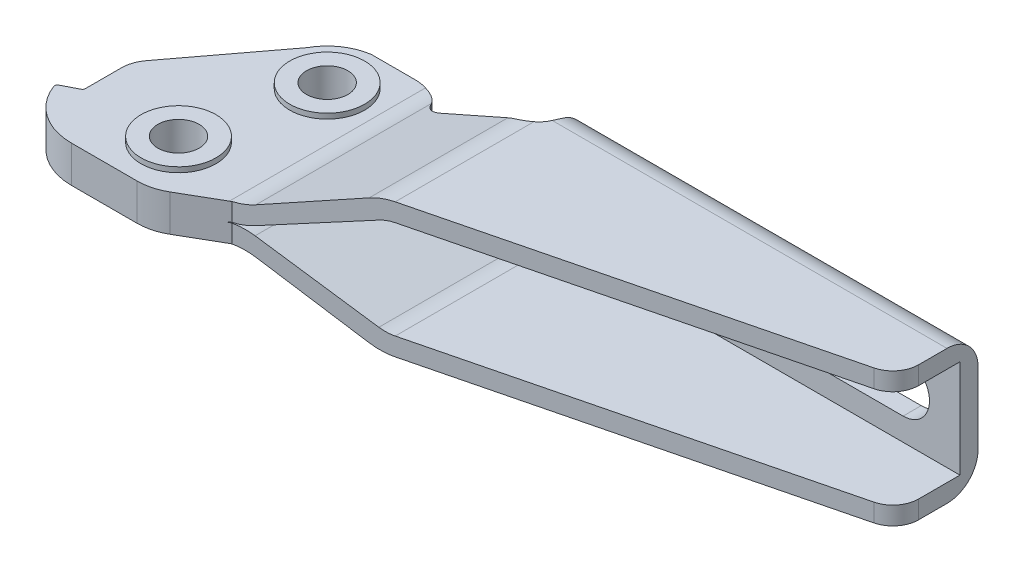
ISO-10303-21;
HEADER;
FILE_DESCRIPTION(('STEP AP214'),'2;1');
FILE_NAME('part.step','',(''),(''),'','','');
FILE_SCHEMA(('AUTOMOTIVE_DESIGN { 1 0 10303 214 1 1 1 1 }'));
ENDSEC;
DATA;
#1=APPLICATION_CONTEXT('core data for automotive mechanical design processes');
#2=APPLICATION_PROTOCOL_DEFINITION('international standard','automotive_design',2000,#1);
#3=PRODUCT_CONTEXT('',#1,'mechanical');
#4=PRODUCT('Part','Part','',(#3));
#5=PRODUCT_RELATED_PRODUCT_CATEGORY('part','',(#4));
#6=PRODUCT_DEFINITION_FORMATION('','',#4);
#7=PRODUCT_DEFINITION_CONTEXT('part definition',#1,'design');
#8=PRODUCT_DEFINITION('design','',#6,#7);
#9=PRODUCT_DEFINITION_SHAPE('','',#8);
#10=(LENGTH_UNIT() NAMED_UNIT(*) SI_UNIT(.MILLI.,.METRE.));
#11=(NAMED_UNIT(*) PLANE_ANGLE_UNIT() SI_UNIT($,.RADIAN.));
#12=(NAMED_UNIT(*) SI_UNIT($,.STERADIAN.) SOLID_ANGLE_UNIT());
#13=UNCERTAINTY_MEASURE_WITH_UNIT(LENGTH_MEASURE(1.E-05),#10,'distance_accuracy_value','');
#14=(GEOMETRIC_REPRESENTATION_CONTEXT(3) GLOBAL_UNCERTAINTY_ASSIGNED_CONTEXT((#13)) GLOBAL_UNIT_ASSIGNED_CONTEXT((#10,
#11,#12)) REPRESENTATION_CONTEXT('',''));
#15=CARTESIAN_POINT('',(0.,0.,0.));
#16=DIRECTION('',(0.,0.,1.));
#17=DIRECTION('',(1.,0.,0.));
#18=AXIS2_PLACEMENT_3D('',#15,#16,#17);
#19=CARTESIAN_POINT('',(-5.4,-3.55,23.38));
#20=DIRECTION('',(0.,-1.,0.));
#21=DIRECTION('',(-0.712638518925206,0.,-0.701531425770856));
#22=AXIS2_PLACEMENT_3D('',#19,#20,#21);
#23=CONICAL_SURFACE('',#22,7.3,0.785398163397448);
#24=CARTESIAN_POINT('',(-5.4,-3.75,23.38));
#25=DIRECTION('',(0.,-1.,0.));
#26=DIRECTION('',(-0.712638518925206,0.,-0.701531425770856));
#27=AXIS2_PLACEMENT_3D('',#24,#25,#26);
#28=CIRCLE('',#27,7.5);
#29=CARTESIAN_POINT('',(-10.744788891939,-3.75,18.1185143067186));
#30=VERTEX_POINT('',#29);
#31=EDGE_CURVE('E811',#30,#30,#28,.T.);
#32=ORIENTED_EDGE('',*,*,#31,.F.);
#33=EDGE_LOOP('',(#32));
#34=FACE_BOUND('',#33,.T.);
#35=CARTESIAN_POINT('',(-5.4,-3.55,23.38));
#36=DIRECTION('',(0.,-1.,0.));
#37=DIRECTION('',(0.,0.,1.));
#38=AXIS2_PLACEMENT_3D('',#35,#36,#37);
#39=CIRCLE('',#38,7.3);
#40=CARTESIAN_POINT('',(-5.4,-3.55,30.68));
#41=VERTEX_POINT('',#40);
#42=EDGE_CURVE('E802',#41,#41,#39,.F.);
#43=ORIENTED_EDGE('',*,*,#42,.F.);
#44=EDGE_LOOP('',(#43));
#45=FACE_BOUND('',#44,.T.);
#46=ADVANCED_FACE('F14',(#34,#45),#23,.T.);
#47=CARTESIAN_POINT('',(-5.4,-3.55,23.38));
#48=DIRECTION('',(0.,-1.,0.));
#49=DIRECTION('',(-0.712638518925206,0.,-0.701531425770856));
#50=AXIS2_PLACEMENT_3D('',#47,#48,#49);
#51=CYLINDRICAL_SURFACE('',#50,7.5);
#52=CARTESIAN_POINT('',(-5.4,-4.3,23.38));
#53=DIRECTION('',(0.,1.,0.));
#54=DIRECTION('',(-1.,0.,0.));
#55=AXIS2_PLACEMENT_3D('',#52,#53,#54);
#56=CIRCLE('',#55,7.5);
#57=CARTESIAN_POINT('',(-12.9,-4.3,23.38));
#58=VERTEX_POINT('',#57);
#59=EDGE_CURVE('E808',#58,#58,#56,.T.);
#60=ORIENTED_EDGE('',*,*,#59,.T.);
#61=EDGE_LOOP('',(#60));
#62=FACE_BOUND('',#61,.T.);
#63=ORIENTED_EDGE('',*,*,#31,.T.);
#64=EDGE_LOOP('',(#63));
#65=FACE_BOUND('',#64,.T.);
#66=ADVANCED_FACE('F597',(#62,#65),#51,.T.);
#67=CARTESIAN_POINT('',(-5.4,-4.55,23.38));
#68=DIRECTION('',(0.,1.,0.));
#69=DIRECTION('',(0.712638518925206,0.,0.701531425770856));
#70=AXIS2_PLACEMENT_3D('',#67,#68,#69);
#71=CYLINDRICAL_SURFACE('',#70,4.);
#72=CARTESIAN_POINT('',(-5.4,4.55,23.38));
#73=DIRECTION('',(0.,-1.,0.));
#74=DIRECTION('',(1.,0.,0.));
#75=AXIS2_PLACEMENT_3D('',#72,#73,#74);
#76=CIRCLE('',#75,4.);
#77=CARTESIAN_POINT('',(-1.4,4.55,23.38));
#78=VERTEX_POINT('',#77);
#79=EDGE_CURVE('E817',#78,#78,#76,.F.);
#80=ORIENTED_EDGE('',*,*,#79,.T.);
#81=EDGE_LOOP('',(#80));
#82=FACE_BOUND('',#81,.T.);
#83=CARTESIAN_POINT('',(-5.4,-4.55,23.38));
#84=DIRECTION('',(0.,1.,0.));
#85=DIRECTION('',(-1.,0.,0.));
#86=AXIS2_PLACEMENT_3D('',#83,#84,#85);
#87=CIRCLE('',#86,4.);
#88=CARTESIAN_POINT('',(-9.4,-4.55,23.38));
#89=VERTEX_POINT('',#88);
#90=EDGE_CURVE('E383',#89,#89,#87,.F.);
#91=ORIENTED_EDGE('',*,*,#90,.T.);
#92=EDGE_LOOP('',(#91));
#93=FACE_BOUND('',#92,.T.);
#94=ADVANCED_FACE('F841',(#82,#93),#71,.F.);
#95=CARTESIAN_POINT('',(0.,-3.55,0.));
#96=DIRECTION('',(0.,-1.,0.));
#97=DIRECTION('',(-0.712638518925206,0.,-0.701531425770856));
#98=AXIS2_PLACEMENT_3D('',#95,#96,#97);
#99=CONICAL_SURFACE('',#98,7.3,0.785398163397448);
#100=CARTESIAN_POINT('',(0.,-3.75,0.));
#101=DIRECTION('',(0.,-1.,0.));
#102=DIRECTION('',(-0.712638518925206,0.,-0.701531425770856));
#103=AXIS2_PLACEMENT_3D('',#100,#101,#102);
#104=CIRCLE('',#103,7.5);
#105=CARTESIAN_POINT('',(-5.34478889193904,-3.75,-5.26148569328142));
#106=VERTEX_POINT('',#105);
#107=EDGE_CURVE('E371',#106,#106,#104,.T.);
#108=ORIENTED_EDGE('',*,*,#107,.F.);
#109=EDGE_LOOP('',(#108));
#110=FACE_BOUND('',#109,.T.);
#111=CARTESIAN_POINT('',(0.,-3.55,0.));
#112=DIRECTION('',(0.,-1.,0.));
#113=DIRECTION('',(0.,0.,1.));
#114=AXIS2_PLACEMENT_3D('',#111,#112,#113);
#115=CIRCLE('',#114,7.3);
#116=CARTESIAN_POINT('',(0.,-3.55,7.3));
#117=VERTEX_POINT('',#116);
#118=EDGE_CURVE('E805',#117,#117,#115,.F.);
#119=ORIENTED_EDGE('',*,*,#118,.F.);
#120=EDGE_LOOP('',(#119));
#121=FACE_BOUND('',#120,.T.);
#122=ADVANCED_FACE('F871',(#110,#121),#99,.T.);
#123=CARTESIAN_POINT('',(0.,-3.55,0.));
#124=DIRECTION('',(0.,-1.,0.));
#125=DIRECTION('',(-0.712638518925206,0.,-0.701531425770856));
#126=AXIS2_PLACEMENT_3D('',#123,#124,#125);
#127=CYLINDRICAL_SURFACE('',#126,7.5);
#128=CARTESIAN_POINT('',(0.,-4.3,0.));
#129=DIRECTION('',(0.,1.,0.));
#130=DIRECTION('',(0.,0.,-1.));
#131=AXIS2_PLACEMENT_3D('',#128,#129,#130);
#132=CIRCLE('',#131,7.5);
#133=CARTESIAN_POINT('',(0.,-4.3,-7.5));
#134=VERTEX_POINT('',#133);
#135=EDGE_CURVE('E826',#134,#134,#132,.T.);
#136=ORIENTED_EDGE('',*,*,#135,.T.);
#137=EDGE_LOOP('',(#136));
#138=FACE_BOUND('',#137,.T.);
#139=ORIENTED_EDGE('',*,*,#107,.T.);
#140=EDGE_LOOP('',(#139));
#141=FACE_BOUND('',#140,.T.);
#142=ADVANCED_FACE('F878',(#138,#141),#127,.T.);
#143=CARTESIAN_POINT('',(0.,-4.55,0.));
#144=DIRECTION('',(0.,1.,0.));
#145=DIRECTION('',(0.712638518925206,0.,0.701531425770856));
#146=AXIS2_PLACEMENT_3D('',#143,#144,#145);
#147=CYLINDRICAL_SURFACE('',#146,4.);
#148=CARTESIAN_POINT('',(0.,4.55,0.));
#149=DIRECTION('',(0.,-1.,0.));
#150=DIRECTION('',(1.,0.,0.));
#151=AXIS2_PLACEMENT_3D('',#148,#149,#150);
#152=CIRCLE('',#151,4.);
#153=CARTESIAN_POINT('',(4.,4.55,0.));
#154=VERTEX_POINT('',#153);
#155=EDGE_CURVE('E818',#154,#154,#152,.F.);
#156=ORIENTED_EDGE('',*,*,#155,.T.);
#157=EDGE_LOOP('',(#156));
#158=FACE_BOUND('',#157,.T.);
#159=CARTESIAN_POINT('',(0.,-4.55,0.));
#160=DIRECTION('',(0.,1.,0.));
#161=DIRECTION('',(-1.,0.,0.));
#162=AXIS2_PLACEMENT_3D('',#159,#160,#161);
#163=CIRCLE('',#162,4.);
#164=CARTESIAN_POINT('',(-4.,-4.55,0.));
#165=VERTEX_POINT('',#164);
#166=EDGE_CURVE('E814',#165,#165,#163,.F.);
#167=ORIENTED_EDGE('',*,*,#166,.T.);
#168=EDGE_LOOP('',(#167));
#169=FACE_BOUND('',#168,.T.);
#170=ADVANCED_FACE('F895',(#158,#169),#147,.F.);
#171=CARTESIAN_POINT('',(48.,0.,-17.49));
#172=DIRECTION('',(0.,0.,1.));
#173=DIRECTION('',(0.,1.,0.));
#174=AXIS2_PLACEMENT_3D('',#171,#172,#173);
#175=CYLINDRICAL_SURFACE('',#174,5.1);
#176=CARTESIAN_POINT('',(48.,0.,-12.99));
#177=DIRECTION('',(0.,0.,-1.));
#178=DIRECTION('',(0.,-1.,0.));
#179=AXIS2_PLACEMENT_3D('',#176,#177,#178);
#180=CIRCLE('',#179,5.1);
#181=CARTESIAN_POINT('',(48.,-5.1,-12.99));
#182=VERTEX_POINT('',#181);
#183=CARTESIAN_POINT('',(48.,5.1,-12.99));
#184=VERTEX_POINT('',#183);
#185=EDGE_CURVE('E362',#182,#184,#180,.T.);
#186=ORIENTED_EDGE('',*,*,#185,.T.);
#187=DIRECTION('',(0.,0.,1.));
#188=VECTOR('',#187,1.);
#189=CARTESIAN_POINT('',(48.,5.1,-17.49));
#190=LINE('',#189,#188);
#191=CARTESIAN_POINT('',(48.,5.1,-9.49));
#192=VERTEX_POINT('',#191);
#193=EDGE_CURVE('E389',#184,#192,#190,.T.);
#194=ORIENTED_EDGE('',*,*,#193,.T.);
#195=CARTESIAN_POINT('',(48.,0.,-9.49));
#196=DIRECTION('',(0.,0.,1.));
#197=DIRECTION('',(1.,0.,0.));
#198=AXIS2_PLACEMENT_3D('',#195,#196,#197);
#199=CIRCLE('',#198,5.1);
#200=CARTESIAN_POINT('',(48.,-5.1,-9.49));
#201=VERTEX_POINT('',#200);
#202=EDGE_CURVE('E380',#192,#201,#199,.T.);
#203=ORIENTED_EDGE('',*,*,#202,.T.);
#204=DIRECTION('',(0.,0.,1.));
#205=VECTOR('',#204,1.);
#206=CARTESIAN_POINT('',(48.,-5.1,-17.49));
#207=LINE('',#206,#205);
#208=EDGE_CURVE('E31',#182,#201,#207,.T.);
#209=ORIENTED_EDGE('',*,*,#208,.F.);
#210=EDGE_LOOP('',(#186,#194,#203,#209));
#211=FACE_BOUND('',#210,.T.);
#212=ADVANCED_FACE('F881',(#211),#175,.F.);
#213=CARTESIAN_POINT('',(102.,5.1,-17.49));
#214=DIRECTION('',(0.,1.,0.));
#215=DIRECTION('',(-1.,0.,0.));
#216=AXIS2_PLACEMENT_3D('',#213,#214,#215);
#217=PLANE('',#216);
#218=DIRECTION('',(1.,0.,0.));
#219=VECTOR('',#218,1.);
#220=CARTESIAN_POINT('',(113.,5.1,-12.99));
#221=LINE('',#220,#219);
#222=CARTESIAN_POINT('',(102.,5.1,-12.99));
#223=VERTEX_POINT('',#222);
#224=EDGE_CURVE('E393',#184,#223,#221,.T.);
#225=ORIENTED_EDGE('',*,*,#224,.T.);
#226=DIRECTION('',(0.,0.,1.));
#227=VECTOR('',#226,1.);
#228=CARTESIAN_POINT('',(102.,5.1,-17.49));
#229=LINE('',#228,#227);
#230=CARTESIAN_POINT('',(102.,5.1,-9.49));
#231=VERTEX_POINT('',#230);
#232=EDGE_CURVE('E363',#223,#231,#229,.T.);
#233=ORIENTED_EDGE('',*,*,#232,.T.);
#234=DIRECTION('',(-1.,0.,0.));
#235=VECTOR('',#234,1.);
#236=CARTESIAN_POINT('',(102.,5.1,-9.49));
#237=LINE('',#236,#235);
#238=EDGE_CURVE('E39',#231,#192,#237,.T.);
#239=ORIENTED_EDGE('',*,*,#238,.T.);
#240=ORIENTED_EDGE('',*,*,#193,.F.);
#241=EDGE_LOOP('',(#225,#233,#239,#240));
#242=FACE_BOUND('',#241,.T.);
#243=ADVANCED_FACE('F1486',(#242),#217,.F.);
#244=CARTESIAN_POINT('',(102.,0.,-17.49));
#245=DIRECTION('',(0.,0.,1.));
#246=DIRECTION('',(0.,1.,0.));
#247=AXIS2_PLACEMENT_3D('',#244,#245,#246);
#248=CYLINDRICAL_SURFACE('',#247,5.1);
#249=CARTESIAN_POINT('',(102.,0.,-12.99));
#250=DIRECTION('',(0.,0.,-1.));
#251=DIRECTION('',(0.,-1.,0.));
#252=AXIS2_PLACEMENT_3D('',#249,#250,#251);
#253=CIRCLE('',#252,5.1);
#254=CARTESIAN_POINT('',(102.,-5.1,-12.99));
#255=VERTEX_POINT('',#254);
#256=EDGE_CURVE('E359',#223,#255,#253,.T.);
#257=ORIENTED_EDGE('',*,*,#256,.T.);
#258=DIRECTION('',(0.,0.,1.));
#259=VECTOR('',#258,1.);
#260=CARTESIAN_POINT('',(102.,-5.1,-17.49));
#261=LINE('',#260,#259);
#262=CARTESIAN_POINT('',(102.,-5.1,-9.49));
#263=VERTEX_POINT('',#262);
#264=EDGE_CURVE('E352',#255,#263,#261,.T.);
#265=ORIENTED_EDGE('',*,*,#264,.T.);
#266=CARTESIAN_POINT('',(102.,0.,-9.49));
#267=DIRECTION('',(0.,0.,1.));
#268=DIRECTION('',(-1.,0.,0.));
#269=AXIS2_PLACEMENT_3D('',#266,#267,#268);
#270=CIRCLE('',#269,5.1);
#271=EDGE_CURVE('E357',#263,#231,#270,.T.);
#272=ORIENTED_EDGE('',*,*,#271,.T.);
#273=ORIENTED_EDGE('',*,*,#232,.F.);
#274=EDGE_LOOP('',(#257,#265,#272,#273));
#275=FACE_BOUND('',#274,.T.);
#276=ADVANCED_FACE('F354',(#275),#248,.F.);
#277=CARTESIAN_POINT('',(48.,-5.1,-17.49));
#278=DIRECTION('',(0.,-1.,0.));
#279=DIRECTION('',(1.,0.,0.));
#280=AXIS2_PLACEMENT_3D('',#277,#278,#279);
#281=PLANE('',#280);
#282=DIRECTION('',(-1.,0.,0.));
#283=VECTOR('',#282,1.);
#284=CARTESIAN_POINT('',(113.,-5.1,-12.99));
#285=LINE('',#284,#283);
#286=EDGE_CURVE('E396',#255,#182,#285,.T.);
#287=ORIENTED_EDGE('',*,*,#286,.T.);
#288=ORIENTED_EDGE('',*,*,#208,.T.);
#289=DIRECTION('',(1.,0.,0.));
#290=VECTOR('',#289,1.);
#291=CARTESIAN_POINT('',(48.,-5.1,-9.49));
#292=LINE('',#291,#290);
#293=EDGE_CURVE('E366',#201,#263,#292,.T.);
#294=ORIENTED_EDGE('',*,*,#293,.T.);
#295=ORIENTED_EDGE('',*,*,#264,.F.);
#296=EDGE_LOOP('',(#287,#288,#294,#295));
#297=FACE_BOUND('',#296,.T.);
#298=ADVANCED_FACE('F367',(#297),#281,.F.);
#299=CARTESIAN_POINT('',(113.,6.99999999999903,-6.98999999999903));
#300=DIRECTION('',(-1.,0.,0.));
#301=DIRECTION('',(0.,-1.,0.));
#302=AXIS2_PLACEMENT_3D('',#299,#300,#301);
#303=CYLINDRICAL_SURFACE('',#302,6.00000000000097);
#304=CARTESIAN_POINT('',(37.,12.6533087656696,-9.));
#305=CARTESIAN_POINT('',(37.0000209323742,12.6911532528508,-8.89362775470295));
#306=CARTESIAN_POINT('',(36.9966059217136,12.7259583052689,-8.78615604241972));
#307=CARTESIAN_POINT('',(36.9826336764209,12.7893722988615,-8.56981211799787));
#308=CARTESIAN_POINT('',(36.972073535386,12.8179787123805,-8.46093935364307));
#309=CARTESIAN_POINT('',(36.9438561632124,12.8682839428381,-8.24509632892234));
#310=CARTESIAN_POINT('',(36.9263612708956,12.8901216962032,-8.13813732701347));
#311=CARTESIAN_POINT('',(36.8841999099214,12.9277503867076,-7.92462512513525));
#312=CARTESIAN_POINT('',(36.8595367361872,12.9435440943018,-7.81807176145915));
#313=CARTESIAN_POINT('',(36.7987696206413,12.9711725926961,-7.59013636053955));
#314=CARTESIAN_POINT('',(36.7614998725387,12.9820481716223,-7.46894730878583));
#315=CARTESIAN_POINT('',(36.677170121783,12.9965279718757,-7.22779458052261));
#316=CARTESIAN_POINT('',(36.6299889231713,13.000035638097,-7.10786742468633));
#317=CARTESIAN_POINT('',(36.5781983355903,13.,-6.99));
#318=B_SPLINE_CURVE_WITH_KNOTS('',3,(#304,#305,#306,#307,#308,#309,#310,#311,#312,#313,#314,
#315,#316,#317),.UNSPECIFIED.,.F.,.F.,(4,2,2,2,2,2,4),(0.,0.338639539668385,0.677416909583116,
1.00869227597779,1.33981561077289,1.72098798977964,2.10712517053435),.UNSPECIFIED.);
#319=CARTESIAN_POINT('',(37.,12.6533087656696,-9.));
#320=VERTEX_POINT('',#319);
#321=CARTESIAN_POINT('',(36.5781983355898,13.,-6.99));
#322=VERTEX_POINT('',#321);
#323=EDGE_CURVE('E984',#320,#322,#318,.T.);
#324=ORIENTED_EDGE('',*,*,#323,.T.);
#325=DIRECTION('',(-1.,0.,0.));
#326=VECTOR('',#325,1.);
#327=CARTESIAN_POINT('',(113.,13.,-6.99));
#328=LINE('',#327,#326);
#329=CARTESIAN_POINT('',(113.,13.,-6.99));
#330=VERTEX_POINT('',#329);
#331=EDGE_CURVE('E404',#330,#322,#328,.T.);
#332=ORIENTED_EDGE('',*,*,#331,.F.);
#333=CARTESIAN_POINT('',(113.,6.99999999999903,-6.98999999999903));
#334=DIRECTION('',(1.,0.,0.));
#335=DIRECTION('',(0.,0.,1.));
#336=AXIS2_PLACEMENT_3D('',#333,#334,#335);
#337=CIRCLE('',#336,6.00000000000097);
#338=CARTESIAN_POINT('',(113.,6.99999999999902,-12.99));
#339=VERTEX_POINT('',#338);
#340=EDGE_CURVE('E401',#339,#330,#337,.T.);
#341=ORIENTED_EDGE('',*,*,#340,.F.);
#342=DIRECTION('',(-1.,0.,0.));
#343=VECTOR('',#342,1.);
#344=CARTESIAN_POINT('',(113.,7.,-12.99));
#345=LINE('',#344,#343);
#346=CARTESIAN_POINT('',(37.,7.,-12.99));
#347=VERTEX_POINT('',#346);
#348=EDGE_CURVE('E407',#339,#347,#345,.T.);
#349=ORIENTED_EDGE('',*,*,#348,.T.);
#350=CARTESIAN_POINT('',(37.,6.99999999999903,-6.98999999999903));
#351=DIRECTION('',(-1.,0.,0.));
#352=DIRECTION('',(0.,-1.,0.));
#353=AXIS2_PLACEMENT_3D('',#350,#351,#352);
#354=CIRCLE('',#353,6.00000000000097);
#355=EDGE_CURVE('E424',#347,#320,#354,.F.);
#356=ORIENTED_EDGE('',*,*,#355,.T.);
#357=EDGE_LOOP('',(#324,#332,#341,#349,#356));
#358=FACE_BOUND('',#357,.T.);
#359=ADVANCED_FACE('F435',(#358),#303,.T.);
#360=CARTESIAN_POINT('',(113.,-6.99999999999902,-6.98999999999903));
#361=DIRECTION('',(-1.,0.,0.));
#362=DIRECTION('',(0.,-1.,0.));
#363=AXIS2_PLACEMENT_3D('',#360,#361,#362);
#364=CYLINDRICAL_SURFACE('',#363,6.00000000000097);
#365=CARTESIAN_POINT('',(36.5781983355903,-13.,-6.99));
#366=CARTESIAN_POINT('',(36.6236059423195,-13.0000199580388,-7.09337084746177));
#367=CARTESIAN_POINT('',(36.6654792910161,-12.9973291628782,-7.19831178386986));
#368=CARTESIAN_POINT('',(36.741974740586,-12.9861816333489,-7.41055144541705));
#369=CARTESIAN_POINT('',(36.7765938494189,-12.9777225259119,-7.51785112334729));
#370=CARTESIAN_POINT('',(36.8376763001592,-12.9549484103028,-7.73154619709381));
#371=CARTESIAN_POINT('',(36.8643033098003,-12.9407672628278,-7.83790897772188));
#372=CARTESIAN_POINT('',(36.9103577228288,-12.9064024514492,-8.05116665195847));
#373=CARTESIAN_POINT('',(36.9297884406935,-12.8862215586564,-8.15806127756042));
#374=CARTESIAN_POINT('',(36.9639243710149,-12.8362759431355,-8.38773589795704));
#375=CARTESIAN_POINT('',(36.9774713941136,-12.8055236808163,-8.51047480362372));
#376=CARTESIAN_POINT('',(36.9955875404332,-12.7356753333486,-8.75597181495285));
#377=CARTESIAN_POINT('',(37.0000374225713,-12.6964757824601,-8.87870934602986));
#378=CARTESIAN_POINT('',(37.,-12.6533087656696,-9.));
#379=B_SPLINE_CURVE_WITH_KNOTS('',3,(#365,#366,#367,#368,#369,#370,#371,#372,#373,#374,#375,
#376,#377,#378),.UNSPECIFIED.,.F.,.F.,(4,2,2,2,2,2,4),(0.,0.33863983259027,0.677419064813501,
1.00869421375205,1.33981659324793,1.72098839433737,2.10712519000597),.UNSPECIFIED.);
#380=CARTESIAN_POINT('',(36.5781983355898,-13.,-6.99));
#381=VERTEX_POINT('',#380);
#382=CARTESIAN_POINT('',(37.,-12.6533087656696,-9.));
#383=VERTEX_POINT('',#382);
#384=EDGE_CURVE('E416',#381,#383,#379,.T.);
#385=ORIENTED_EDGE('',*,*,#384,.T.);
#386=CARTESIAN_POINT('',(37.,-6.99999999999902,-6.98999999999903));
#387=DIRECTION('',(-1.,0.,0.));
#388=DIRECTION('',(0.,-1.,0.));
#389=AXIS2_PLACEMENT_3D('',#386,#387,#388);
#390=CIRCLE('',#389,6.00000000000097);
#391=CARTESIAN_POINT('',(37.,-7.,-12.99));
#392=VERTEX_POINT('',#391);
#393=EDGE_CURVE('E414',#383,#392,#390,.F.);
#394=ORIENTED_EDGE('',*,*,#393,.T.);
#395=DIRECTION('',(-1.,0.,0.));
#396=VECTOR('',#395,1.);
#397=CARTESIAN_POINT('',(113.,-7.,-12.99));
#398=LINE('',#397,#396);
#399=CARTESIAN_POINT('',(113.,-7.,-12.99));
#400=VERTEX_POINT('',#399);
#401=EDGE_CURVE('E409',#400,#392,#398,.T.);
#402=ORIENTED_EDGE('',*,*,#401,.F.);
#403=CARTESIAN_POINT('',(113.,-6.99999999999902,-6.98999999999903));
#404=DIRECTION('',(1.,0.,0.));
#405=DIRECTION('',(0.,0.,1.));
#406=AXIS2_PLACEMENT_3D('',#403,#404,#405);
#407=CIRCLE('',#406,6.00000000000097);
#408=CARTESIAN_POINT('',(113.,-13.,-6.99));
#409=VERTEX_POINT('',#408);
#410=EDGE_CURVE('E398',#409,#400,#407,.T.);
#411=ORIENTED_EDGE('',*,*,#410,.F.);
#412=DIRECTION('',(-1.,0.,0.));
#413=VECTOR('',#412,1.);
#414=CARTESIAN_POINT('',(113.,-13.,-6.99));
#415=LINE('',#414,#413);
#416=EDGE_CURVE('E412',#409,#381,#415,.T.);
#417=ORIENTED_EDGE('',*,*,#416,.T.);
#418=EDGE_LOOP('',(#385,#394,#402,#411,#417));
#419=FACE_BOUND('',#418,.T.);
#420=ADVANCED_FACE('F430',(#419),#364,.T.);
#421=CARTESIAN_POINT('',(35.0199999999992,3.00000000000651,-9.49));
#422=DIRECTION('',(0.,0.,1.));
#423=DIRECTION('',(0.,1.,0.));
#424=AXIS2_PLACEMENT_3D('',#421,#422,#423);
#425=PLANE('',#424);
#426=ORIENTED_EDGE('',*,*,#293,.F.);
#427=ORIENTED_EDGE('',*,*,#202,.F.);
#428=ORIENTED_EDGE('',*,*,#238,.F.);
#429=ORIENTED_EDGE('',*,*,#271,.F.);
#430=EDGE_LOOP('',(#426,#427,#428,#429));
#431=FACE_BOUND('',#430,.T.);
#432=DIRECTION('',(-1.,0.,0.));
#433=VECTOR('',#432,1.);
#434=CARTESIAN_POINT('',(115.,9.5,-9.49));
#435=LINE('',#434,#433);
#436=CARTESIAN_POINT('',(113.,9.5,-9.49));
#437=VERTEX_POINT('',#436);
#438=CARTESIAN_POINT('',(37.,9.5,-9.49));
#439=VERTEX_POINT('',#438);
#440=EDGE_CURVE('E983',#437,#439,#435,.T.);
#441=ORIENTED_EDGE('',*,*,#440,.T.);
#442=DIRECTION('',(0.,1.,0.));
#443=VECTOR('',#442,1.);
#444=CARTESIAN_POINT('',(37.,-13.,-9.49));
#445=LINE('',#444,#443);
#446=CARTESIAN_POINT('',(37.,-9.5,-9.49));
#447=VERTEX_POINT('',#446);
#448=EDGE_CURVE('E778',#447,#439,#445,.T.);
#449=ORIENTED_EDGE('',*,*,#448,.F.);
#450=DIRECTION('',(1.,0.,0.));
#451=VECTOR('',#450,1.);
#452=CARTESIAN_POINT('',(35.02,-9.5,-9.49));
#453=LINE('',#452,#451);
#454=CARTESIAN_POINT('',(113.,-9.5,-9.49));
#455=VERTEX_POINT('',#454);
#456=EDGE_CURVE('E979',#447,#455,#453,.T.);
#457=ORIENTED_EDGE('',*,*,#456,.T.);
#458=DIRECTION('',(0.,-1.,0.));
#459=VECTOR('',#458,1.);
#460=CARTESIAN_POINT('',(113.,-13.,-9.49));
#461=LINE('',#460,#459);
#462=EDGE_CURVE('E933',#437,#455,#461,.T.);
#463=ORIENTED_EDGE('',*,*,#462,.F.);
#464=EDGE_LOOP('',(#441,#449,#457,#463));
#465=FACE_BOUND('',#464,.T.);
#466=ADVANCED_FACE('F373',(#431,#465),#425,.T.);
#467=CARTESIAN_POINT('',(35.0199999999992,-3.00000000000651,34.4));
#468=DIRECTION('',(0.,0.,-1.));
#469=DIRECTION('',(0.,-1.,0.));
#470=AXIS2_PLACEMENT_3D('',#467,#468,#469);
#471=CYLINDRICAL_SURFACE('',#470,6.49999999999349);
#472=DIRECTION('',(0.,0.,-1.));
#473=VECTOR('',#472,1.);
#474=CARTESIAN_POINT('',(32.480273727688,-8.9832926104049,34.4));
#475=LINE('',#474,#473);
#476=CARTESIAN_POINT('',(32.480273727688,-8.9832926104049,22.482250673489));
#477=VERTEX_POINT('',#476);
#478=CARTESIAN_POINT('',(32.480273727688,-8.9832926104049,-4.02311973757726));
#479=VERTEX_POINT('',#478);
#480=EDGE_CURVE('E973',#477,#479,#475,.T.);
#481=ORIENTED_EDGE('',*,*,#480,.F.);
#482=CARTESIAN_POINT('',(35.0199999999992,-3.00000000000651,21.8490257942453));
#483=DIRECTION('',(0.241921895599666,0.,0.970295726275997));
#484=DIRECTION('',(0.970295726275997,0.,-0.241921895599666));
#485=AXIS2_PLACEMENT_3D('',#482,#483,#484);
#486=ELLIPSE('',#485,6.69898859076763,6.49999999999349);
#487=CARTESIAN_POINT('',(35.02,-9.5,21.849025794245));
#488=VERTEX_POINT('',#487);
#489=EDGE_CURVE('E781',#488,#477,#486,.F.);
#490=ORIENTED_EDGE('',*,*,#489,.F.);
#491=DIRECTION('',(0.,0.,-1.));
#492=VECTOR('',#491,1.);
#493=CARTESIAN_POINT('',(35.02,-9.5,34.4));
#494=LINE('',#493,#492);
#495=CARTESIAN_POINT('',(35.02,-9.5,-5.01507841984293));
#496=VERTEX_POINT('',#495);
#497=EDGE_CURVE('E976',#488,#496,#494,.T.);
#498=ORIENTED_EDGE('',*,*,#497,.T.);
#499=CARTESIAN_POINT('',(32.480273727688,-8.9832926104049,-4.02311973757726));
#500=CARTESIAN_POINT('',(32.5903757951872,-9.03005700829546,-4.0337201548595));
#501=CARTESIAN_POINT('',(32.701493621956,-9.07360759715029,-4.04815457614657));
#502=CARTESIAN_POINT('',(32.9247855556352,-9.1541914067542,-4.08497073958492));
#503=CARTESIAN_POINT('',(33.0369598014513,-9.19122375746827,-4.10735354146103));
#504=CARTESIAN_POINT('',(33.258203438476,-9.25772025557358,-4.15959784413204));
#505=CARTESIAN_POINT('',(33.367271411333,-9.28736798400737,-4.1892312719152));
#506=CARTESIAN_POINT('',(33.5844736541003,-9.34048541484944,-4.25633514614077));
#507=CARTESIAN_POINT('',(33.6926080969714,-9.36395628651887,-4.29380410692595));
#508=CARTESIAN_POINT('',(33.9060446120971,-9.40474859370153,-4.37615303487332));
#509=CARTESIAN_POINT('',(34.0113634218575,-9.42212350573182,-4.42096322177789));
#510=CARTESIAN_POINT('',(34.2193126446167,-9.45135104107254,-4.51805559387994));
#511=CARTESIAN_POINT('',(34.3219424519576,-9.46320243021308,-4.57033944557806));
#512=CARTESIAN_POINT('',(34.5265845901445,-9.4820824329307,-4.68370172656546));
#513=CARTESIAN_POINT('',(34.6284942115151,-9.48896248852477,-4.74498989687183));
#514=CARTESIAN_POINT('',(34.8278036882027,-9.49792674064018,-4.87474679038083));
#515=CARTESIAN_POINT('',(34.9252052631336,-9.50001278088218,-4.94321274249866));
#516=CARTESIAN_POINT('',(35.02,-9.5,-5.01507841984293));
#517=B_SPLINE_CURVE_WITH_KNOTS('',3,(#499,#500,#501,#502,#503,#504,#505,#506,#507,#508,#509,
#510,#511,#512,#513,#514,#515,#516),.UNSPECIFIED.,.F.,.F.,(4,2,2,2,2,2,2,2,4),(0.,
0.360193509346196,0.720435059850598,1.07054360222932,1.42058582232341,1.76747566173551,
2.1144429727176,2.47139235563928,2.8282044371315),.UNSPECIFIED.);
#518=EDGE_CURVE('E450',#479,#496,#517,.T.);
#519=ORIENTED_EDGE('',*,*,#518,.F.);
#520=EDGE_LOOP('',(#481,#490,#498,#519));
#521=FACE_BOUND('',#520,.T.);
#522=ADVANCED_FACE('F441',(#521),#471,.F.);
#523=CARTESIAN_POINT('',(13.307271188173,-0.84493444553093,34.4));
#524=DIRECTION('',(0.390727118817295,0.92050655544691,0.));
#525=DIRECTION('',(-0.92050655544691,0.390727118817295,0.));
#526=AXIS2_PLACEMENT_3D('',#523,#524,#525);
#527=PLANE('',#526);
#528=DIRECTION('',(0.92050655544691,-0.390727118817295,0.));
#529=VECTOR('',#528,1.);
#530=CARTESIAN_POINT('',(33.517998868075,-9.42377546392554,-4.));
#531=LINE('',#530,#529);
#532=CARTESIAN_POINT('',(17.954451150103,-2.81752141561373,-4.));
#533=VERTEX_POINT('',#532);
#534=CARTESIAN_POINT('',(32.,-8.77943097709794,-4.));
#535=VERTEX_POINT('',#534);
#536=EDGE_CURVE('E466',#533,#535,#531,.T.);
#537=ORIENTED_EDGE('',*,*,#536,.F.);
#538=CARTESIAN_POINT('',(17.9544511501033,-2.81752141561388,-8.99999999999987));
#539=DIRECTION('',(0.390727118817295,0.92050655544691,0.));
#540=DIRECTION('',(-0.92050655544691,0.390727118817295,0.));
#541=AXIS2_PLACEMENT_3D('',#538,#539,#540);
#542=ELLIPSE('',#541,5.43179184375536,4.99999999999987);
#543=CARTESIAN_POINT('',(13.741200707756,-1.02912436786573,-6.3076923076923));
#544=VERTEX_POINT('',#543);
#545=EDGE_CURVE('E463',#544,#533,#542,.T.);
#546=ORIENTED_EDGE('',*,*,#545,.F.);
#547=CARTESIAN_POINT('',(6.99999999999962,1.83231090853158,-1.99999999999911));
#548=DIRECTION('',(0.390727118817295,0.92050655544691,0.));
#549=DIRECTION('',(-0.92050655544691,0.390727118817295,0.));
#550=AXIS2_PLACEMENT_3D('',#547,#548,#549);
#551=ELLIPSE('',#550,8.69086695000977,8.00000000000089);
#552=CARTESIAN_POINT('',(13.307271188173,-0.84493444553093,-6.92121226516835));
#553=VERTEX_POINT('',#552);
#554=EDGE_CURVE('E458',#553,#544,#551,.F.);
#555=ORIENTED_EDGE('',*,*,#554,.F.);
#556=DIRECTION('',(0.,0.,-1.));
#557=VECTOR('',#556,1.);
#558=CARTESIAN_POINT('',(13.307271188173,-0.84493444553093,34.4));
#559=LINE('',#558,#557);
#560=CARTESIAN_POINT('',(13.307271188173,-0.84493444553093,27.2626171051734));
#561=VERTEX_POINT('',#560);
#562=EDGE_CURVE('E970',#561,#553,#559,.T.);
#563=ORIENTED_EDGE('',*,*,#562,.F.);
#564=DIRECTION('',(-0.897180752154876,0.380826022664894,0.223692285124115));
#565=VECTOR('',#564,1.);
#566=CARTESIAN_POINT('',(14.3771690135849,-1.29907362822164,26.9958616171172));
#567=LINE('',#566,#565);
#568=EDGE_CURVE('E784',#477,#561,#567,.T.);
#569=ORIENTED_EDGE('',*,*,#568,.F.);
#570=ORIENTED_EDGE('',*,*,#480,.T.);
#571=CARTESIAN_POINT('',(32.0000000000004,-8.7794309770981,-8.99999999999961));
#572=DIRECTION('',(0.390727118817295,0.92050655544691,0.));
#573=DIRECTION('',(-0.92050655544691,0.390727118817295,0.));
#574=AXIS2_PLACEMENT_3D('',#571,#572,#573);
#575=ELLIPSE('',#574,5.43179184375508,4.99999999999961);
#576=EDGE_CURVE('E469',#535,#479,#575,.T.);
#577=ORIENTED_EDGE('',*,*,#576,.F.);
#578=EDGE_LOOP('',(#537,#546,#555,#563,#569,#570,#577));
#579=FACE_BOUND('',#578,.T.);
#580=ADVANCED_FACE('F446',(#579),#527,.T.);
#581=CARTESIAN_POINT('',(9.39999999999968,-10.0500000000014,34.4));
#582=DIRECTION('',(0.,0.,-1.));
#583=DIRECTION('',(0.,-1.,0.));
#584=AXIS2_PLACEMENT_3D('',#581,#582,#583);
#585=CYLINDRICAL_SURFACE('',#584,10.0000000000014);
#586=CARTESIAN_POINT('',(9.39999999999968,-10.0500000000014,-9.49));
#587=DIRECTION('',(0.,0.,-1.));
#588=DIRECTION('',(-1.,0.,0.));
#589=AXIS2_PLACEMENT_3D('',#586,#587,#588);
#590=CIRCLE('',#589,10.0000000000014);
#591=CARTESIAN_POINT('',(9.2585821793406,-0.051,-9.49));
#592=VERTEX_POINT('',#591);
#593=CARTESIAN_POINT('',(9.81067607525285,-0.0584363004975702,-9.49));
#594=VERTEX_POINT('',#593);
#595=EDGE_CURVE('E978',#592,#594,#590,.T.);
#596=ORIENTED_EDGE('',*,*,#595,.F.);
#597=DIRECTION('',(0.,0.,-1.));
#598=VECTOR('',#597,1.);
#599=CARTESIAN_POINT('',(9.2585821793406,-0.051,34.4));
#600=LINE('',#599,#598);
#601=CARTESIAN_POINT('',(9.2585821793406,-0.051,28.4172446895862));
#602=VERTEX_POINT('',#601);
#603=EDGE_CURVE('E968',#602,#592,#600,.T.);
#604=ORIENTED_EDGE('',*,*,#603,.F.);
#605=CARTESIAN_POINT('',(9.39999999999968,-10.0500000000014,28.3355970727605));
#606=DIRECTION('',(0.499999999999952,0.,0.866025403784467));
#607=DIRECTION('',(0.866025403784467,0.,-0.499999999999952));
#608=AXIS2_PLACEMENT_3D('',#605,#606,#607);
#609=ELLIPSE('',#608,11.5470053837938,10.0000000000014);
#610=CARTESIAN_POINT('',(9.701162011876,-0.05453595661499,28.161721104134));
#611=VERTEX_POINT('',#610);
#612=EDGE_CURVE('E472',#611,#602,#609,.T.);
#613=ORIENTED_EDGE('',*,*,#612,.F.);
#614=CARTESIAN_POINT('',(9.39999999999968,-10.0500000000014,28.2368092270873));
#615=DIRECTION('',(0.241921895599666,0.,0.970295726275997));
#616=DIRECTION('',(0.970295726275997,0.,-0.241921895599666));
#617=AXIS2_PLACEMENT_3D('',#614,#615,#616);
#618=ELLIPSE('',#617,10.3061362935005,10.0000000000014);
#619=EDGE_CURVE('E787',#561,#611,#618,.T.);
#620=ORIENTED_EDGE('',*,*,#619,.F.);
#621=ORIENTED_EDGE('',*,*,#562,.T.);
#622=CARTESIAN_POINT('',(9.81067607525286,-0.0584363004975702,-9.49));
#623=CARTESIAN_POINT('',(10.0139986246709,-0.0667543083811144,-9.41374636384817));
#624=CARTESIAN_POINT('',(10.2138750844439,-0.0812229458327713,-9.32925602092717));
#625=CARTESIAN_POINT('',(10.6050860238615,-0.120943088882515,-9.14491994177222));
#626=CARTESIAN_POINT('',(10.7964284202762,-0.146184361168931,-9.0450888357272));
#627=CARTESIAN_POINT('',(11.1649574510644,-0.205254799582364,-8.83354067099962));
#628=CARTESIAN_POINT('',(11.3423703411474,-0.238869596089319,-8.72215571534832));
#629=CARTESIAN_POINT('',(11.686902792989,-0.313413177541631,-8.48663782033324));
#630=CARTESIAN_POINT('',(11.854021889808,-0.354342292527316,-8.36250430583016));
#631=CARTESIAN_POINT('',(12.1351223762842,-0.430516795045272,-8.13629154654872));
#632=CARTESIAN_POINT('',(12.2516175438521,-0.464470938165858,-8.03687562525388));
#633=CARTESIAN_POINT('',(12.4782946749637,-0.534844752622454,-7.83194840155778));
#634=CARTESIAN_POINT('',(12.5884778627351,-0.571263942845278,-7.72643828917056));
#635=CARTESIAN_POINT('',(12.8042507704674,-0.646576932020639,-7.50769460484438));
#636=CARTESIAN_POINT('',(12.9097231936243,-0.685503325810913,-7.3943566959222));
#637=CARTESIAN_POINT('',(13.1137420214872,-0.764522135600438,-7.16198188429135));
#638=CARTESIAN_POINT('',(13.212288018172,-0.804614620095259,-7.04294464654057));
#639=CARTESIAN_POINT('',(13.307271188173,-0.84493444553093,-6.92121226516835));
#640=B_SPLINE_CURVE_WITH_KNOTS('',3,(#622,#623,#624,#625,#626,#627,#628,#629,#630,#631,#632,
#633,#634,#635,#636,#637,#638,#639),.UNSPECIFIED.,.F.,.F.,(4,2,2,2,2,2,2,2,4),(0.,
0.651524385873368,1.30243123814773,1.93813407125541,2.57386559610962,3.04421708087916,
3.51447702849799,3.99314195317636,4.47183505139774),.UNSPECIFIED.);
#641=EDGE_CURVE('E475',#594,#553,#640,.T.);
#642=ORIENTED_EDGE('',*,*,#641,.F.);
#643=EDGE_LOOP('',(#596,#604,#613,#620,#621,#642));
#644=FACE_BOUND('',#643,.T.);
#645=ADVANCED_FACE('F489',(#644),#585,.T.);
#646=CARTESIAN_POINT('',(9.2585821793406,0.051,34.4));
#647=DIRECTION('',(1.,0.,0.));
#648=DIRECTION('',(0.,1.,0.));
#649=AXIS2_PLACEMENT_3D('',#646,#647,#648);
#650=PLANE('',#649);
#651=ORIENTED_EDGE('',*,*,#603,.T.);
#652=DIRECTION('',(0.,-1.,0.));
#653=VECTOR('',#652,1.);
#654=CARTESIAN_POINT('',(9.2585821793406,0.051,-9.49));
#655=LINE('',#654,#653);
#656=CARTESIAN_POINT('',(9.25858217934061,0.051,-9.49));
#657=VERTEX_POINT('',#656);
#658=EDGE_CURVE('E988',#657,#592,#655,.T.);
#659=ORIENTED_EDGE('',*,*,#658,.F.);
#660=DIRECTION('',(0.,0.,-1.));
#661=VECTOR('',#660,1.);
#662=CARTESIAN_POINT('',(9.25858217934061,0.051,34.4));
#663=LINE('',#662,#661);
#664=CARTESIAN_POINT('',(9.25858217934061,0.051,28.4172446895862));
#665=VERTEX_POINT('',#664);
#666=EDGE_CURVE('E966',#665,#657,#663,.T.);
#667=ORIENTED_EDGE('',*,*,#666,.F.);
#668=DIRECTION('',(0.,1.,0.));
#669=VECTOR('',#668,1.);
#670=CARTESIAN_POINT('',(9.2585821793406,-13.,28.4172446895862));
#671=LINE('',#670,#669);
#672=EDGE_CURVE('E799',#602,#665,#671,.T.);
#673=ORIENTED_EDGE('',*,*,#672,.F.);
#674=EDGE_LOOP('',(#651,#659,#667,#673));
#675=FACE_BOUND('',#674,.T.);
#676=ADVANCED_FACE('F493',(#675),#650,.T.);
#677=CARTESIAN_POINT('',(9.3999999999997,10.0500000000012,34.4));
#678=DIRECTION('',(0.,0.,-1.));
#679=DIRECTION('',(0.,-1.,0.));
#680=AXIS2_PLACEMENT_3D('',#677,#678,#679);
#681=CYLINDRICAL_SURFACE('',#680,10.0000000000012);
#682=DIRECTION('',(0.,0.,-1.));
#683=VECTOR('',#682,1.);
#684=CARTESIAN_POINT('',(13.307271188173,0.84493444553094,34.4));
#685=LINE('',#684,#683);
#686=CARTESIAN_POINT('',(13.307271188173,0.84493444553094,27.2626171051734));
#687=VERTEX_POINT('',#686);
#688=CARTESIAN_POINT('',(13.307271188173,0.84493444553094,-6.92121226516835));
#689=VERTEX_POINT('',#688);
#690=EDGE_CURVE('E963',#687,#689,#685,.T.);
#691=ORIENTED_EDGE('',*,*,#690,.F.);
#692=CARTESIAN_POINT('',(9.3999999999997,10.0500000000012,28.2368092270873));
#693=DIRECTION('',(0.241921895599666,0.,0.970295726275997));
#694=DIRECTION('',(0.970295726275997,0.,-0.241921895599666));
#695=AXIS2_PLACEMENT_3D('',#692,#693,#694);
#696=ELLIPSE('',#695,10.3061362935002,10.0000000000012);
#697=CARTESIAN_POINT('',(9.701162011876,0.0545359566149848,28.161721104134));
#698=VERTEX_POINT('',#697);
#699=EDGE_CURVE('E790',#698,#687,#696,.T.);
#700=ORIENTED_EDGE('',*,*,#699,.F.);
#701=CARTESIAN_POINT('',(9.3999999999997,10.0500000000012,28.3355970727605));
#702=DIRECTION('',(0.499999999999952,0.,0.866025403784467));
#703=DIRECTION('',(0.866025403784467,0.,-0.499999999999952));
#704=AXIS2_PLACEMENT_3D('',#701,#702,#703);
#705=ELLIPSE('',#704,11.5470053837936,10.0000000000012);
#706=EDGE_CURVE('E483',#665,#698,#705,.T.);
#707=ORIENTED_EDGE('',*,*,#706,.F.);
#708=ORIENTED_EDGE('',*,*,#666,.T.);
#709=CARTESIAN_POINT('',(9.3999999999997,10.0500000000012,-9.49));
#710=DIRECTION('',(0.,0.,-1.));
#711=DIRECTION('',(-1.,0.,0.));
#712=AXIS2_PLACEMENT_3D('',#709,#710,#711);
#713=CIRCLE('',#712,10.0000000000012);
#714=CARTESIAN_POINT('',(9.81067607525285,0.0584363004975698,-9.49));
#715=VERTEX_POINT('',#714);
#716=EDGE_CURVE('E992',#715,#657,#713,.T.);
#717=ORIENTED_EDGE('',*,*,#716,.F.);
#718=CARTESIAN_POINT('',(13.307271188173,0.84493444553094,-6.92121226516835));
#719=CARTESIAN_POINT('',(13.1777600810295,0.789951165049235,-7.08719547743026));
#720=CARTESIAN_POINT('',(13.0416096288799,0.73539439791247,-7.24818672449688));
#721=CARTESIAN_POINT('',(12.7564336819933,0.628880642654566,-7.55950378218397));
#722=CARTESIAN_POINT('',(12.6073978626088,0.576925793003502,-7.70982086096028));
#723=CARTESIAN_POINT('',(12.3008641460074,0.478674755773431,-7.99529969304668));
#724=CARTESIAN_POINT('',(12.1436626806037,0.432271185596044,-8.13074235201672));
#725=CARTESIAN_POINT('',(11.8182399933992,0.345338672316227,-8.38966080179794));
#726=CARTESIAN_POINT('',(11.6500235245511,0.304807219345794,-8.5131416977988));
#727=CARTESIAN_POINT('',(11.3491369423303,0.240928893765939,-8.71630114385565));
#728=CARTESIAN_POINT('',(11.2188141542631,0.215870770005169,-8.79893435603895));
#729=CARTESIAN_POINT('',(10.9530152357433,0.170408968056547,-8.95683550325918));
#730=CARTESIAN_POINT('',(10.8175400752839,0.150004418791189,-9.03210481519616));
#731=CARTESIAN_POINT('',(10.5393770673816,0.114114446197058,-9.17619478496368));
#732=CARTESIAN_POINT('',(10.3966027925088,0.0987253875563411,-9.24487301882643));
#733=CARTESIAN_POINT('',(10.1067192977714,0.0739392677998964,-9.37384107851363));
#734=CARTESIAN_POINT('',(9.95960775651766,0.0645454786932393,-9.434126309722));
#735=CARTESIAN_POINT('',(9.81067607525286,0.0584363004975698,-9.49));
#736=B_SPLINE_CURVE_WITH_KNOTS('',3,(#718,#719,#720,#721,#722,#723,#724,#725,#726,#727,#728,
#729,#730,#731,#732,#733,#734,#735),.UNSPECIFIED.,.F.,.F.,(4,2,2,2,2,2,2,2,4),(0.,
0.652679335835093,1.30588657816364,1.94310465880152,2.58004957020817,3.04875081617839,
3.51736425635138,3.99451289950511,4.47192173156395),.UNSPECIFIED.);
#737=EDGE_CURVE('E505',#689,#715,#736,.T.);
#738=ORIENTED_EDGE('',*,*,#737,.F.);
#739=EDGE_LOOP('',(#691,#700,#707,#708,#717,#738));
#740=FACE_BOUND('',#739,.T.);
#741=ADVANCED_FACE('F497',(#740),#681,.T.);
#742=CARTESIAN_POINT('',(32.480273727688,8.9832926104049,34.4));
#743=DIRECTION('',(0.390727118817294,-0.92050655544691,0.));
#744=DIRECTION('',(0.92050655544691,0.390727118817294,0.));
#745=AXIS2_PLACEMENT_3D('',#742,#743,#744);
#746=PLANE('',#745);
#747=DIRECTION('',(0.,0.,-1.));
#748=VECTOR('',#747,1.);
#749=CARTESIAN_POINT('',(32.480273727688,8.9832926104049,34.4));
#750=LINE('',#749,#748);
#751=CARTESIAN_POINT('',(32.480273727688,8.9832926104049,22.482250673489));
#752=VERTEX_POINT('',#751);
#753=CARTESIAN_POINT('',(32.480273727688,8.9832926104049,-4.02311973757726));
#754=VERTEX_POINT('',#753);
#755=EDGE_CURVE('E960',#752,#754,#750,.T.);
#756=ORIENTED_EDGE('',*,*,#755,.F.);
#757=DIRECTION('',(0.897180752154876,0.380826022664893,-0.223692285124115));
#758=VECTOR('',#757,1.);
#759=CARTESIAN_POINT('',(5.49375479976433,-2.47166631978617,29.2107455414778));
#760=LINE('',#759,#758);
#761=EDGE_CURVE('E793',#687,#752,#760,.T.);
#762=ORIENTED_EDGE('',*,*,#761,.F.);
#763=ORIENTED_EDGE('',*,*,#690,.T.);
#764=CARTESIAN_POINT('',(6.99999999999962,-1.83231090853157,-1.99999999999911));
#765=DIRECTION('',(0.390727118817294,-0.92050655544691,0.));
#766=DIRECTION('',(0.92050655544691,0.390727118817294,0.));
#767=AXIS2_PLACEMENT_3D('',#764,#765,#766);
#768=ELLIPSE('',#767,8.69086695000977,8.00000000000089);
#769=CARTESIAN_POINT('',(13.741200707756,1.02912436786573,-6.3076923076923));
#770=VERTEX_POINT('',#769);
#771=EDGE_CURVE('E512',#770,#689,#768,.F.);
#772=ORIENTED_EDGE('',*,*,#771,.F.);
#773=CARTESIAN_POINT('',(17.9544511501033,2.81752141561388,-8.99999999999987));
#774=DIRECTION('',(0.390727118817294,-0.92050655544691,0.));
#775=DIRECTION('',(0.92050655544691,0.390727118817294,0.));
#776=AXIS2_PLACEMENT_3D('',#773,#774,#775);
#777=ELLIPSE('',#776,5.43179184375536,4.99999999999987);
#778=CARTESIAN_POINT('',(17.954451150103,2.81752141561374,-4.));
#779=VERTEX_POINT('',#778);
#780=EDGE_CURVE('E515',#779,#770,#777,.T.);
#781=ORIENTED_EDGE('',*,*,#780,.F.);
#782=DIRECTION('',(-0.92050655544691,-0.390727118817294,0.));
#783=VECTOR('',#782,1.);
#784=CARTESIAN_POINT('',(24.1666601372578,5.45441574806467,-4.));
#785=LINE('',#784,#783);
#786=CARTESIAN_POINT('',(32.,8.77943097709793,-4.));
#787=VERTEX_POINT('',#786);
#788=EDGE_CURVE('E518',#787,#779,#785,.T.);
#789=ORIENTED_EDGE('',*,*,#788,.F.);
#790=CARTESIAN_POINT('',(32.0000000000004,8.7794309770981,-8.99999999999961));
#791=DIRECTION('',(0.390727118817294,-0.92050655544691,0.));
#792=DIRECTION('',(0.92050655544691,0.390727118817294,0.));
#793=AXIS2_PLACEMENT_3D('',#790,#791,#792);
#794=ELLIPSE('',#793,5.43179184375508,4.99999999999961);
#795=EDGE_CURVE('E521',#754,#787,#794,.T.);
#796=ORIENTED_EDGE('',*,*,#795,.F.);
#797=EDGE_LOOP('',(#756,#762,#763,#772,#781,#789,#796));
#798=FACE_BOUND('',#797,.T.);
#799=ADVANCED_FACE('F502',(#798),#746,.T.);
#800=CARTESIAN_POINT('',(35.0199999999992,3.00000000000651,34.4));
#801=DIRECTION('',(0.,0.,-1.));
#802=DIRECTION('',(0.,-1.,0.));
#803=AXIS2_PLACEMENT_3D('',#800,#801,#802);
#804=CYLINDRICAL_SURFACE('',#803,6.49999999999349);
#805=DIRECTION('',(0.,0.,-1.));
#806=VECTOR('',#805,1.);
#807=CARTESIAN_POINT('',(35.02,9.5,34.4));
#808=LINE('',#807,#806);
#809=CARTESIAN_POINT('',(35.02,9.5,21.849025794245));
#810=VERTEX_POINT('',#809);
#811=CARTESIAN_POINT('',(35.02,9.5,-5.01507841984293));
#812=VERTEX_POINT('',#811);
#813=EDGE_CURVE('E957',#810,#812,#808,.T.);
#814=ORIENTED_EDGE('',*,*,#813,.F.);
#815=CARTESIAN_POINT('',(35.0199999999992,3.00000000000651,21.8490257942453));
#816=DIRECTION('',(0.241921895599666,0.,0.970295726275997));
#817=DIRECTION('',(0.970295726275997,0.,-0.241921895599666));
#818=AXIS2_PLACEMENT_3D('',#815,#816,#817);
#819=ELLIPSE('',#818,6.69898859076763,6.49999999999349);
#820=EDGE_CURVE('E796',#752,#810,#819,.F.);
#821=ORIENTED_EDGE('',*,*,#820,.F.);
#822=ORIENTED_EDGE('',*,*,#755,.T.);
#823=CARTESIAN_POINT('',(35.02,9.5,-5.01507841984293));
#824=CARTESIAN_POINT('',(34.9242305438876,9.50001338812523,-4.94247291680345));
#825=CARTESIAN_POINT('',(34.8257993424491,9.49788390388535,-4.8733378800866));
#826=CARTESIAN_POINT('',(34.6243433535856,9.48872721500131,-4.74239443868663));
#827=CARTESIAN_POINT('',(34.5213167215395,9.4816980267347,-4.68058901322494));
#828=CARTESIAN_POINT('',(34.3144418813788,9.46240530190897,-4.56638582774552));
#829=CARTESIAN_POINT('',(34.2106990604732,9.45029520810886,-4.51377166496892));
#830=CARTESIAN_POINT('',(34.000497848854,9.42042657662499,-4.41617758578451));
#831=CARTESIAN_POINT('',(33.8940401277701,9.40266941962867,-4.37119580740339));
#832=CARTESIAN_POINT('',(33.6804546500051,9.36139284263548,-4.28947934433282));
#833=CARTESIAN_POINT('',(33.5733465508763,9.33793773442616,-4.25266082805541));
#834=CARTESIAN_POINT('',(33.3582456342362,9.28497004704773,-4.18670283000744));
#835=CARTESIAN_POINT('',(33.2502526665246,9.25545641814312,-4.15756468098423));
#836=CARTESIAN_POINT('',(33.0312393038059,9.18936686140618,-4.10617301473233));
#837=CARTESIAN_POINT('',(32.92022085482,9.15261275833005,-4.08414076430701));
#838=CARTESIAN_POINT('',(32.6992280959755,9.07271866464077,-4.04786120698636));
#839=CARTESIAN_POINT('',(32.5892536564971,9.02957947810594,-4.03361292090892));
#840=CARTESIAN_POINT('',(32.480273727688,8.9832926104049,-4.02311973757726));
#841=B_SPLINE_CURVE_WITH_KNOTS('',3,(#823,#824,#825,#826,#827,#828,#829,#830,#831,#832,#833,
#834,#835,#836,#837,#838,#839,#840),.UNSPECIFIED.,.F.,.F.,(4,2,2,2,2,2,2,2,4),(0.,
0.360481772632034,0.72110956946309,1.07155202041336,1.42190885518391,1.76848137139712,
2.11511398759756,2.47168187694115,2.82820490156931),.UNSPECIFIED.);
#842=EDGE_CURVE('E524',#812,#754,#841,.T.);
#843=ORIENTED_EDGE('',*,*,#842,.F.);
#844=EDGE_LOOP('',(#814,#821,#822,#843));
#845=FACE_BOUND('',#844,.T.);
#846=ADVANCED_FACE('F533',(#845),#804,.F.);
#847=CARTESIAN_POINT('',(115.,9.5,34.4));
#848=DIRECTION('',(0.,-1.,0.));
#849=DIRECTION('',(1.,0.,0.));
#850=AXIS2_PLACEMENT_3D('',#847,#848,#849);
#851=PLANE('',#850);
#852=DIRECTION('',(0.,0.,1.));
#853=VECTOR('',#852,1.);
#854=CARTESIAN_POINT('',(37.,9.5,-12.99));
#855=LINE('',#854,#853);
#856=CARTESIAN_POINT('',(37.,9.5,-9.));
#857=VERTEX_POINT('',#856);
#858=EDGE_CURVE('E948',#439,#857,#855,.T.);
#859=ORIENTED_EDGE('',*,*,#858,.F.);
#860=ORIENTED_EDGE('',*,*,#440,.F.);
#861=DIRECTION('',(0.,0.,-1.));
#862=VECTOR('',#861,1.);
#863=CARTESIAN_POINT('',(113.,9.5,-1.5));
#864=LINE('',#863,#862);
#865=CARTESIAN_POINT('',(113.,9.5,-1.5));
#866=VERTEX_POINT('',#865);
#867=EDGE_CURVE('E954',#866,#437,#864,.T.);
#868=ORIENTED_EDGE('',*,*,#867,.F.);
#869=CARTESIAN_POINT('',(107.999999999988,9.5,-1.50000000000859));
#870=DIRECTION('',(0.,-1.,0.));
#871=DIRECTION('',(1.,0.,0.));
#872=AXIS2_PLACEMENT_3D('',#869,#870,#871);
#873=CIRCLE('',#872,5.00000000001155);
#874=CARTESIAN_POINT('',(109.209609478,9.5,3.35147863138));
#875=VERTEX_POINT('',#874);
#876=EDGE_CURVE('E772',#875,#866,#873,.F.);
#877=ORIENTED_EDGE('',*,*,#876,.F.);
#878=DIRECTION('',(0.970295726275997,0.,-0.241921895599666));
#879=VECTOR('',#878,1.);
#880=CARTESIAN_POINT('',(9.701162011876,9.5,28.161721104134));
#881=LINE('',#880,#879);
#882=EDGE_CURVE('E951',#810,#875,#881,.T.);
#883=ORIENTED_EDGE('',*,*,#882,.F.);
#884=ORIENTED_EDGE('',*,*,#813,.T.);
#885=CARTESIAN_POINT('',(32.0000000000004,9.5,-8.99999999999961));
#886=DIRECTION('',(0.,-1.,0.));
#887=DIRECTION('',(1.,0.,0.));
#888=AXIS2_PLACEMENT_3D('',#885,#886,#887);
#889=CIRCLE('',#888,4.99999999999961);
#890=EDGE_CURVE('E945',#857,#812,#889,.T.);
#891=ORIENTED_EDGE('',*,*,#890,.F.);
#892=EDGE_LOOP('',(#859,#860,#868,#877,#883,#884,#891));
#893=FACE_BOUND('',#892,.T.);
#894=ADVANCED_FACE('F537',(#893),#851,.T.);
#895=CARTESIAN_POINT('',(35.02,-9.5,34.4));
#896=DIRECTION('',(0.,1.,0.));
#897=DIRECTION('',(-1.,0.,0.));
#898=AXIS2_PLACEMENT_3D('',#895,#896,#897);
#899=PLANE('',#898);
#900=ORIENTED_EDGE('',*,*,#497,.F.);
#901=DIRECTION('',(-0.970295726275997,0.,0.241921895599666));
#902=VECTOR('',#901,1.);
#903=CARTESIAN_POINT('',(9.701162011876,-9.5,28.161721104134));
#904=LINE('',#903,#902);
#905=CARTESIAN_POINT('',(109.209609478,-9.5,3.35147863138));
#906=VERTEX_POINT('',#905);
#907=EDGE_CURVE('E937',#906,#488,#904,.T.);
#908=ORIENTED_EDGE('',*,*,#907,.F.);
#909=CARTESIAN_POINT('',(107.999999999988,-9.5,-1.50000000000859));
#910=DIRECTION('',(0.,1.,0.));
#911=DIRECTION('',(-1.,0.,0.));
#912=AXIS2_PLACEMENT_3D('',#909,#910,#911);
#913=CIRCLE('',#912,5.00000000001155);
#914=CARTESIAN_POINT('',(113.,-9.5,-1.5));
#915=VERTEX_POINT('',#914);
#916=EDGE_CURVE('E775',#915,#906,#913,.F.);
#917=ORIENTED_EDGE('',*,*,#916,.F.);
#918=DIRECTION('',(0.,0.,1.));
#919=VECTOR('',#918,1.);
#920=CARTESIAN_POINT('',(113.,-9.5,-1.5));
#921=LINE('',#920,#919);
#922=EDGE_CURVE('E942',#455,#915,#921,.T.);
#923=ORIENTED_EDGE('',*,*,#922,.F.);
#924=ORIENTED_EDGE('',*,*,#456,.F.);
#925=DIRECTION('',(0.,0.,-1.));
#926=VECTOR('',#925,1.);
#927=CARTESIAN_POINT('',(37.,-9.5,-12.99));
#928=LINE('',#927,#926);
#929=CARTESIAN_POINT('',(37.,-9.5,-9.));
#930=VERTEX_POINT('',#929);
#931=EDGE_CURVE('E934',#930,#447,#928,.T.);
#932=ORIENTED_EDGE('',*,*,#931,.F.);
#933=CARTESIAN_POINT('',(32.0000000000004,-9.5,-8.99999999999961));
#934=DIRECTION('',(0.,1.,0.));
#935=DIRECTION('',(-1.,0.,0.));
#936=AXIS2_PLACEMENT_3D('',#933,#934,#935);
#937=CIRCLE('',#936,4.99999999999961);
#938=EDGE_CURVE('E930',#496,#930,#937,.T.);
#939=ORIENTED_EDGE('',*,*,#938,.F.);
#940=EDGE_LOOP('',(#900,#908,#917,#923,#924,#932,#939));
#941=FACE_BOUND('',#940,.T.);
#942=ADVANCED_FACE('F541',(#941),#899,.T.);
#943=ORIENTED_EDGE('',*,*,#716,.T.);
#944=ORIENTED_EDGE('',*,*,#658,.T.);
#945=ORIENTED_EDGE('',*,*,#595,.T.);
#946=DIRECTION('',(0.,1.,0.));
#947=VECTOR('',#946,1.);
#948=CARTESIAN_POINT('',(9.81067607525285,-13.,-9.49));
#949=LINE('',#948,#947);
#950=EDGE_CURVE('E459',#715,#594,#949,.F.);
#951=ORIENTED_EDGE('',*,*,#950,.F.);
#952=EDGE_LOOP('',(#943,#944,#945,#951));
#953=FACE_BOUND('',#952,.T.);
#954=ADVANCED_FACE('F442',(#953),#425,.T.);
#955=CARTESIAN_POINT('',(35.0199999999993,3.00000000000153,35.89));
#956=DIRECTION('',(0.,0.,-1.));
#957=DIRECTION('',(0.,-1.,0.));
#958=AXIS2_PLACEMENT_3D('',#955,#956,#957);
#959=CYLINDRICAL_SURFACE('',#958,9.99999999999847);
#960=CARTESIAN_POINT('',(35.0199999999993,3.00000000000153,-4.));
#961=DIRECTION('',(0.,0.,-1.));
#962=DIRECTION('',(0.,-1.,0.));
#963=AXIS2_PLACEMENT_3D('',#960,#961,#962);
#964=CIRCLE('',#963,9.99999999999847);
#965=CARTESIAN_POINT('',(30.980566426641,12.147839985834,-4.));
#966=VERTEX_POINT('',#965);
#967=CARTESIAN_POINT('',(32.,12.5330792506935,-4.));
#968=VERTEX_POINT('',#967);
#969=EDGE_CURVE('E563',#966,#968,#964,.T.);
#970=ORIENTED_EDGE('',*,*,#969,.F.);
#971=DIRECTION('',(0.,0.,-1.));
#972=VECTOR('',#971,1.);
#973=CARTESIAN_POINT('',(30.980566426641,12.147839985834,35.89));
#974=LINE('',#973,#972);
#975=CARTESIAN_POINT('',(30.980566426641,12.147839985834,22.8561696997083));
#976=VERTEX_POINT('',#975);
#977=EDGE_CURVE('E1044',#976,#966,#974,.T.);
#978=ORIENTED_EDGE('',*,*,#977,.F.);
#979=CARTESIAN_POINT('',(35.0199999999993,3.00000000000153,21.8490257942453));
#980=DIRECTION('',(0.241921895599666,0.,0.970295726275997));
#981=DIRECTION('',(0.970295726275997,0.,-0.241921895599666));
#982=AXIS2_PLACEMENT_3D('',#979,#980,#981);
#983=ELLIPSE('',#982,10.3061362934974,9.99999999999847);
#984=CARTESIAN_POINT('',(35.0199999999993,13.,21.8490257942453));
#985=VERTEX_POINT('',#984);
#986=EDGE_CURVE('E1046',#985,#976,#983,.T.);
#987=ORIENTED_EDGE('',*,*,#986,.F.);
#988=DIRECTION('',(0.,0.,-1.));
#989=VECTOR('',#988,1.);
#990=CARTESIAN_POINT('',(35.02,13.,35.89));
#991=LINE('',#990,#989);
#992=CARTESIAN_POINT('',(35.02,13.,-5.01507841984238));
#993=VERTEX_POINT('',#992);
#994=EDGE_CURVE('E531',#985,#993,#991,.T.);
#995=ORIENTED_EDGE('',*,*,#994,.T.);
#996=CARTESIAN_POINT('',(32.,12.5330792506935,-4.));
#997=CARTESIAN_POINT('',(32.1255935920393,12.5728903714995,-3.99997936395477));
#998=CARTESIAN_POINT('',(32.2520071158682,12.6101825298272,-4.00473177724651));
#999=CARTESIAN_POINT('',(32.505522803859,12.6795948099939,-4.02400208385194));
#1000=CARTESIAN_POINT('',(32.6326250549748,12.7117142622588,-4.0385212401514));
#1001=CARTESIAN_POINT('',(32.8828019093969,12.7697705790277,-4.07697094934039));
#1002=CARTESIAN_POINT('',(33.0058850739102,12.7958614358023,-4.10061228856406));
#1003=CARTESIAN_POINT('',(33.2508105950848,12.8430440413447,-4.15734867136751));
#1004=CARTESIAN_POINT('',(33.3726530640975,12.8641362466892,-4.19044285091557));
#1005=CARTESIAN_POINT('',(33.6273661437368,12.9034810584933,-4.27016121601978));
#1006=CARTESIAN_POINT('',(33.7599862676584,12.9211711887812,-4.31786898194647));
#1007=CARTESIAN_POINT('',(34.0212897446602,12.9508736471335,-4.42459615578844));
#1008=CARTESIAN_POINT('',(34.1499718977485,12.962884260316,-4.48361897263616));
#1009=CARTESIAN_POINT('',(34.4063951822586,12.9820110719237,-4.61472161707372));
#1010=CARTESIAN_POINT('',(34.5339591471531,12.9889490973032,-4.68717378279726));
#1011=CARTESIAN_POINT('',(34.7823313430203,12.9979527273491,-4.84305317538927));
#1012=CARTESIAN_POINT('',(34.9031414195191,13.0000196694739,-4.92647738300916));
#1013=CARTESIAN_POINT('',(35.02,13.,-5.01507841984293));
#1014=B_SPLINE_CURVE_WITH_KNOTS('',3,(#996,#997,#998,#999,#1000,#1001,#1002,#1003,#1004,#1005,
#1006,#1007,#1008,#1009,#1010,#1011,#1012,#1013),.UNSPECIFIED.,.F.,.F.,(4,2,2,2,2,2,2,2,4),(0.,
0.395175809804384,0.79040273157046,1.1740111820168,1.55758458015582,1.98308925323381,
2.40872232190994,2.84866869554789,3.28849425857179),.UNSPECIFIED.);
#1015=EDGE_CURVE('E554',#968,#993,#1014,.T.);
#1016=ORIENTED_EDGE('',*,*,#1015,.F.);
#1017=EDGE_LOOP('',(#970,#978,#987,#995,#1016));
#1018=FACE_BOUND('',#1017,.T.);
#1019=ADVANCED_FACE('F546',(#1018),#959,.T.);
#1020=CARTESIAN_POINT('',(13.439433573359,4.4021600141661,35.89));
#1021=DIRECTION('',(-0.40394335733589,0.914783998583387,0.));
#1022=DIRECTION('',(-0.914783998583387,-0.40394335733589,0.));
#1023=AXIS2_PLACEMENT_3D('',#1020,#1021,#1022);
#1024=PLANE('',#1023);
#1025=CARTESIAN_POINT('',(17.9544511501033,6.39586712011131,-8.99999999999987));
#1026=DIRECTION('',(-0.40394335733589,0.914783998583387,0.));
#1027=DIRECTION('',(0.914783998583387,0.40394335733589,0.));
#1028=AXIS2_PLACEMENT_3D('',#1025,#1026,#1027);
#1029=ELLIPSE('',#1028,5.4657711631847,4.99999999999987);
#1030=CARTESIAN_POINT('',(13.741200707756,4.53541204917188,-6.3076923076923));
#1031=VERTEX_POINT('',#1030);
#1032=CARTESIAN_POINT('',(17.954451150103,6.39586712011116,-4.));
#1033=VERTEX_POINT('',#1032);
#1034=EDGE_CURVE('E567',#1031,#1033,#1029,.T.);
#1035=ORIENTED_EDGE('',*,*,#1034,.F.);
#1036=CARTESIAN_POINT('',(6.99999999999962,1.55868393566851,-1.99999999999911));
#1037=DIRECTION('',(-0.40394335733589,0.914783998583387,0.));
#1038=DIRECTION('',(0.914783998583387,0.40394335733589,0.));
#1039=AXIS2_PLACEMENT_3D('',#1036,#1037,#1038);
#1040=ELLIPSE('',#1039,8.74523386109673,8.00000000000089);
#1041=CARTESIAN_POINT('',(13.439433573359,4.4021600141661,-6.74696695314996));
#1042=VERTEX_POINT('',#1041);
#1043=EDGE_CURVE('E562',#1042,#1031,#1040,.F.);
#1044=ORIENTED_EDGE('',*,*,#1043,.F.);
#1045=DIRECTION('',(0.,0.,-1.));
#1046=VECTOR('',#1045,1.);
#1047=CARTESIAN_POINT('',(13.439433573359,4.40216001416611,35.89));
#1048=LINE('',#1047,#1046);
#1049=CARTESIAN_POINT('',(13.439433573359,4.40216001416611,27.229665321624));
#1050=VERTEX_POINT('',#1049);
#1051=EDGE_CURVE('E1039',#1050,#1042,#1048,.T.);
#1052=ORIENTED_EDGE('',*,*,#1051,.F.);
#1053=DIRECTION('',(-0.891879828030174,-0.393829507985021,0.22237061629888));
#1054=VECTOR('',#1053,1.);
#1055=CARTESIAN_POINT('',(4.16848998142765,0.308367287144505,29.541171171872));
#1056=LINE('',#1055,#1054);
#1057=EDGE_CURVE('E763',#976,#1050,#1056,.T.);
#1058=ORIENTED_EDGE('',*,*,#1057,.F.);
#1059=ORIENTED_EDGE('',*,*,#977,.T.);
#1060=DIRECTION('',(0.914783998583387,0.40394335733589,0.));
#1061=VECTOR('',#1060,1.);
#1062=CARTESIAN_POINT('',(22.5410058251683,8.42116303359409,-4.));
#1063=LINE('',#1062,#1061);
#1064=EDGE_CURVE('E570',#1033,#966,#1063,.T.);
#1065=ORIENTED_EDGE('',*,*,#1064,.F.);
#1066=EDGE_LOOP('',(#1035,#1044,#1052,#1058,#1059,#1065));
#1067=FACE_BOUND('',#1066,.T.);
#1068=ADVANCED_FACE('F550',(#1067),#1024,.T.);
#1069=CARTESIAN_POINT('',(9.40000000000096,13.5499999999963,35.89));
#1070=DIRECTION('',(0.,0.,-1.));
#1071=DIRECTION('',(0.,-1.,0.));
#1072=AXIS2_PLACEMENT_3D('',#1069,#1070,#1071);
#1073=CYLINDRICAL_SURFACE('',#1072,9.99999999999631);
#1074=DIRECTION('',(0.,0.,-1.));
#1075=VECTOR('',#1074,1.);
#1076=CARTESIAN_POINT('',(9.4,3.55,35.89));
#1077=LINE('',#1076,#1075);
#1078=CARTESIAN_POINT('',(9.4,3.55,28.3355970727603));
#1079=VERTEX_POINT('',#1078);
#1080=CARTESIAN_POINT('',(9.4,3.55,-9.63151361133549));
#1081=VERTEX_POINT('',#1080);
#1082=EDGE_CURVE('E1043',#1079,#1081,#1077,.T.);
#1083=ORIENTED_EDGE('',*,*,#1082,.F.);
#1084=CARTESIAN_POINT('',(9.40000000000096,13.5499999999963,28.3355970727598));
#1085=DIRECTION('',(0.499999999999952,0.,0.866025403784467));
#1086=DIRECTION('',(0.866025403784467,0.,-0.499999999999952));
#1087=AXIS2_PLACEMENT_3D('',#1084,#1085,#1086);
#1088=ELLIPSE('',#1087,11.5470053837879,9.99999999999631);
#1089=CARTESIAN_POINT('',(9.701162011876,3.55453595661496,28.161721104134));
#1090=VERTEX_POINT('',#1089);
#1091=EDGE_CURVE('E573',#1090,#1079,#1088,.F.);
#1092=ORIENTED_EDGE('',*,*,#1091,.F.);
#1093=CARTESIAN_POINT('',(9.40000000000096,13.5499999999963,28.2368092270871));
#1094=DIRECTION('',(0.241921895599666,0.,0.970295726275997));
#1095=DIRECTION('',(0.970295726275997,0.,-0.241921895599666));
#1096=AXIS2_PLACEMENT_3D('',#1093,#1094,#1095);
#1097=ELLIPSE('',#1096,10.3061362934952,9.99999999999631);
#1098=EDGE_CURVE('E766',#1050,#1090,#1097,.F.);
#1099=ORIENTED_EDGE('',*,*,#1098,.F.);
#1100=ORIENTED_EDGE('',*,*,#1051,.T.);
#1101=CARTESIAN_POINT('',(9.4,3.55,-9.63151361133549));
#1102=CARTESIAN_POINT('',(9.6007340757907,3.54995807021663,-9.56843298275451));
#1103=CARTESIAN_POINT('',(9.79887516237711,3.55604183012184,-9.4973736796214));
#1104=CARTESIAN_POINT('',(10.1882123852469,3.57921865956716,-9.34024011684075));
#1105=CARTESIAN_POINT('',(10.3794157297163,3.59629993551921,-9.25418201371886));
#1106=CARTESIAN_POINT('',(10.7485557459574,3.63964785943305,-9.07034416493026));
#1107=CARTESIAN_POINT('',(10.9267104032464,3.66565684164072,-8.9729391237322));
#1108=CARTESIAN_POINT('',(11.2741595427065,3.72561200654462,-8.76553721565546));
#1109=CARTESIAN_POINT('',(11.4434521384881,3.75955987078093,-8.65553768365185));
#1110=CARTESIAN_POINT('',(11.7824588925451,3.83630157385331,-8.41667410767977));
#1111=CARTESIAN_POINT('',(11.9515524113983,3.87951246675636,-8.28706431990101));
#1112=CARTESIAN_POINT('',(12.2780044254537,3.97159373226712,-8.015625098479));
#1113=CARTESIAN_POINT('',(12.4353606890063,4.02046517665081,-7.8737933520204));
#1114=CARTESIAN_POINT('',(12.7421855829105,4.12361424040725,-7.5744597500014));
#1115=CARTESIAN_POINT('',(12.8912830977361,4.1780090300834,-7.41661842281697));
#1116=CARTESIAN_POINT('',(13.1757544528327,4.28895135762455,-7.08988455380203));
#1117=CARTESIAN_POINT('',(13.3111359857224,4.34549766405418,-6.92099829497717));
#1118=CARTESIAN_POINT('',(13.439433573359,4.4021600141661,-6.74696695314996));
#1119=B_SPLINE_CURVE_WITH_KNOTS('',3,(#1101,#1102,#1103,#1104,#1105,#1106,#1107,#1108,#1109,
#1110,#1111,#1112,#1113,#1114,#1115,#1116,#1117,#1118),.UNSPECIFIED.,.F.,.F.,(4,2,2,2,2,2,2,2,
4),(0.,0.630865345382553,1.26105528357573,1.87440421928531,2.48788318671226,3.13927883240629,
3.79079801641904,4.46159354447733,5.13201074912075),.UNSPECIFIED.);
#1120=EDGE_CURVE('E576',#1081,#1042,#1119,.T.);
#1121=ORIENTED_EDGE('',*,*,#1120,.F.);
#1122=EDGE_LOOP('',(#1083,#1092,#1099,#1100,#1121));
#1123=FACE_BOUND('',#1122,.T.);
#1124=ADVANCED_FACE('F585',(#1123),#1073,.F.);
#1125=CARTESIAN_POINT('',(9.40000000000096,-13.5499999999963,35.89));
#1126=DIRECTION('',(0.,0.,-1.));
#1127=DIRECTION('',(0.,-1.,0.));
#1128=AXIS2_PLACEMENT_3D('',#1125,#1126,#1127);
#1129=CYLINDRICAL_SURFACE('',#1128,9.99999999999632);
#1130=DIRECTION('',(0.,0.,-1.));
#1131=VECTOR('',#1130,1.);
#1132=CARTESIAN_POINT('',(13.439433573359,-4.4021600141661,35.89));
#1133=LINE('',#1132,#1131);
#1134=CARTESIAN_POINT('',(13.439433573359,-4.4021600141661,27.229665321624));
#1135=VERTEX_POINT('',#1134);
#1136=CARTESIAN_POINT('',(13.439433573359,-4.4021600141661,-6.74696695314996));
#1137=VERTEX_POINT('',#1136);
#1138=EDGE_CURVE('E1169',#1135,#1137,#1133,.T.);
#1139=ORIENTED_EDGE('',*,*,#1138,.F.);
#1140=CARTESIAN_POINT('',(9.40000000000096,-13.5499999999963,28.2368092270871));
#1141=DIRECTION('',(0.241921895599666,0.,0.970295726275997));
#1142=DIRECTION('',(0.970295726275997,0.,-0.241921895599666));
#1143=AXIS2_PLACEMENT_3D('',#1140,#1141,#1142);
#1144=ELLIPSE('',#1143,10.3061362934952,9.99999999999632);
#1145=CARTESIAN_POINT('',(9.701162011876,-3.55453595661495,28.161721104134));
#1146=VERTEX_POINT('',#1145);
#1147=EDGE_CURVE('E754',#1146,#1135,#1144,.F.);
#1148=ORIENTED_EDGE('',*,*,#1147,.F.);
#1149=CARTESIAN_POINT('',(9.40000000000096,-13.5499999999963,28.3355970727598));
#1150=DIRECTION('',(0.499999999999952,0.,0.866025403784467));
#1151=DIRECTION('',(0.866025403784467,0.,-0.499999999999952));
#1152=AXIS2_PLACEMENT_3D('',#1149,#1150,#1151);
#1153=ELLIPSE('',#1152,11.5470053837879,9.99999999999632);
#1154=CARTESIAN_POINT('',(9.4,-3.55,28.3355970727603));
#1155=VERTEX_POINT('',#1154);
#1156=EDGE_CURVE('E618',#1155,#1146,#1153,.F.);
#1157=ORIENTED_EDGE('',*,*,#1156,.F.);
#1158=DIRECTION('',(0.,0.,-1.));
#1159=VECTOR('',#1158,1.);
#1160=CARTESIAN_POINT('',(9.4,-3.55,35.89));
#1161=LINE('',#1160,#1159);
#1162=CARTESIAN_POINT('',(9.4,-3.55,-9.63151361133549));
#1163=VERTEX_POINT('',#1162);
#1164=EDGE_CURVE('E1166',#1155,#1163,#1161,.T.);
#1165=ORIENTED_EDGE('',*,*,#1164,.T.);
#1166=CARTESIAN_POINT('',(13.439433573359,-4.4021600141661,-6.74696695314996));
#1167=CARTESIAN_POINT('',(13.3114452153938,-4.34563431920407,-6.92057885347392));
#1168=CARTESIAN_POINT('',(13.1764071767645,-4.28922406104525,-7.08907023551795));
#1169=CARTESIAN_POINT('',(12.8926888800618,-4.17853929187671,-7.4150680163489));
#1170=CARTESIAN_POINT('',(12.7440011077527,-4.12426598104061,-7.57256827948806));
#1171=CARTESIAN_POINT('',(12.4380320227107,-4.02132359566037,-7.87130232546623));
#1172=CARTESIAN_POINT('',(12.2811191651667,-3.97253847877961,-8.01287294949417));
#1173=CARTESIAN_POINT('',(11.9556032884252,-3.8805903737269,-8.28385480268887));
#1174=CARTESIAN_POINT('',(11.7870024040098,-3.83742636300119,-8.41326824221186));
#1175=CARTESIAN_POINT('',(11.4481990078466,-3.76054602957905,-8.65238085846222));
#1176=CARTESIAN_POINT('',(11.2785676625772,-3.72644709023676,-8.76276519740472));
#1177=CARTESIAN_POINT('',(10.9303890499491,-3.66621889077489,-8.97088070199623));
#1178=CARTESIAN_POINT('',(10.7518436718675,-3.64008795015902,-9.06861453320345));
#1179=CARTESIAN_POINT('',(10.3818539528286,-3.5965317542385,-9.25306085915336));
#1180=CARTESIAN_POINT('',(10.1901898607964,-3.57936584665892,-9.33939606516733));
#1181=CARTESIAN_POINT('',(9.79989098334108,-3.5560728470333,-9.49700956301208));
#1182=CARTESIAN_POINT('',(9.60124890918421,-3.54995766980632,-9.56827153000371));
#1183=CARTESIAN_POINT('',(9.4,-3.55,-9.63151361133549));
#1184=B_SPLINE_CURVE_WITH_KNOTS('',3,(#1166,#1167,#1168,#1169,#1170,#1171,#1172,#1173,#1174,
#1175,#1176,#1177,#1178,#1179,#1180,#1181,#1182,#1183),.UNSPECIFIED.,.F.,.F.,(4,2,2,2,2,2,2,2,
4),(0.,0.668801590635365,1.33797359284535,1.98796584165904,2.63783968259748,3.25284939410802,
3.86772930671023,4.49952931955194,5.13201012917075),.UNSPECIFIED.);
#1185=EDGE_CURVE('E609',#1137,#1163,#1184,.T.);
#1186=ORIENTED_EDGE('',*,*,#1185,.F.);
#1187=EDGE_LOOP('',(#1139,#1148,#1157,#1165,#1186));
#1188=FACE_BOUND('',#1187,.T.);
#1189=ADVANCED_FACE('F589',(#1188),#1129,.F.);
#1190=CARTESIAN_POINT('',(30.980566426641,-12.147839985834,35.89));
#1191=DIRECTION('',(-0.40394335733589,-0.914783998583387,0.));
#1192=DIRECTION('',(0.914783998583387,-0.40394335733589,0.));
#1193=AXIS2_PLACEMENT_3D('',#1190,#1191,#1192);
#1194=PLANE('',#1193);
#1195=DIRECTION('',(0.,0.,-1.));
#1196=VECTOR('',#1195,1.);
#1197=CARTESIAN_POINT('',(30.980566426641,-12.147839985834,35.89));
#1198=LINE('',#1197,#1196);
#1199=CARTESIAN_POINT('',(30.980566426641,-12.147839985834,22.8561696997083));
#1200=VERTEX_POINT('',#1199);
#1201=CARTESIAN_POINT('',(30.980566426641,-12.147839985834,-4.));
#1202=VERTEX_POINT('',#1201);
#1203=EDGE_CURVE('E1172',#1200,#1202,#1198,.T.);
#1204=ORIENTED_EDGE('',*,*,#1203,.F.);
#1205=DIRECTION('',(0.891879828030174,-0.393829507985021,-0.22237061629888));
#1206=VECTOR('',#1205,1.);
#1207=CARTESIAN_POINT('',(13.3009534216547,-4.3410110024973,27.2641923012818));
#1208=LINE('',#1207,#1206);
#1209=EDGE_CURVE('E757',#1135,#1200,#1208,.T.);
#1210=ORIENTED_EDGE('',*,*,#1209,.F.);
#1211=ORIENTED_EDGE('',*,*,#1138,.T.);
#1212=CARTESIAN_POINT('',(6.99999999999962,-1.55868393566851,-1.99999999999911));
#1213=DIRECTION('',(-0.40394335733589,-0.914783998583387,0.));
#1214=DIRECTION('',(-0.914783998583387,0.40394335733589,0.));
#1215=AXIS2_PLACEMENT_3D('',#1212,#1213,#1214);
#1216=ELLIPSE('',#1215,8.74523386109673,8.00000000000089);
#1217=CARTESIAN_POINT('',(13.741200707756,-4.53541204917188,-6.3076923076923));
#1218=VERTEX_POINT('',#1217);
#1219=EDGE_CURVE('E617',#1218,#1137,#1216,.F.);
#1220=ORIENTED_EDGE('',*,*,#1219,.F.);
#1221=CARTESIAN_POINT('',(17.9544511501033,-6.39586712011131,-8.99999999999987));
#1222=DIRECTION('',(-0.40394335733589,-0.914783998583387,0.));
#1223=DIRECTION('',(-0.914783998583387,0.40394335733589,0.));
#1224=AXIS2_PLACEMENT_3D('',#1221,#1222,#1223);
#1225=ELLIPSE('',#1224,5.4657711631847,4.99999999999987);
#1226=CARTESIAN_POINT('',(17.954451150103,-6.39586712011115,-4.));
#1227=VERTEX_POINT('',#1226);
#1228=EDGE_CURVE('E622',#1227,#1218,#1225,.T.);
#1229=ORIENTED_EDGE('',*,*,#1228,.F.);
#1230=DIRECTION('',(-0.914783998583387,0.40394335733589,0.));
#1231=VECTOR('',#1230,1.);
#1232=CARTESIAN_POINT('',(32.1485497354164,-12.6635891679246,-4.));
#1233=LINE('',#1232,#1231);
#1234=EDGE_CURVE('E625',#1202,#1227,#1233,.T.);
#1235=ORIENTED_EDGE('',*,*,#1234,.F.);
#1236=EDGE_LOOP('',(#1204,#1210,#1211,#1220,#1229,#1235));
#1237=FACE_BOUND('',#1236,.T.);
#1238=ADVANCED_FACE('F605',(#1237),#1194,.T.);
#1239=CARTESIAN_POINT('',(35.0199999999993,-3.00000000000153,35.89));
#1240=DIRECTION('',(0.,0.,-1.));
#1241=DIRECTION('',(0.,-1.,0.));
#1242=AXIS2_PLACEMENT_3D('',#1239,#1240,#1241);
#1243=CYLINDRICAL_SURFACE('',#1242,9.99999999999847);
#1244=DIRECTION('',(0.,0.,-1.));
#1245=VECTOR('',#1244,1.);
#1246=CARTESIAN_POINT('',(35.02,-13.,35.89));
#1247=LINE('',#1246,#1245);
#1248=CARTESIAN_POINT('',(35.02,-13.,21.8490257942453));
#1249=VERTEX_POINT('',#1248);
#1250=CARTESIAN_POINT('',(35.0199999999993,-13.,-5.01507841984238));
#1251=VERTEX_POINT('',#1250);
#1252=EDGE_CURVE('E1072',#1249,#1251,#1247,.T.);
#1253=ORIENTED_EDGE('',*,*,#1252,.F.);
#1254=CARTESIAN_POINT('',(35.0199999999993,-3.00000000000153,21.8490257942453));
#1255=DIRECTION('',(0.241921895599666,0.,0.970295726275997));
#1256=DIRECTION('',(0.970295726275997,0.,-0.241921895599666));
#1257=AXIS2_PLACEMENT_3D('',#1254,#1255,#1256);
#1258=ELLIPSE('',#1257,10.3061362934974,9.99999999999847);
#1259=EDGE_CURVE('E1084',#1200,#1249,#1258,.T.);
#1260=ORIENTED_EDGE('',*,*,#1259,.F.);
#1261=ORIENTED_EDGE('',*,*,#1203,.T.);
#1262=CARTESIAN_POINT('',(35.0199999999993,-3.00000000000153,-4.));
#1263=DIRECTION('',(0.,0.,-1.));
#1264=DIRECTION('',(0.,-1.,0.));
#1265=AXIS2_PLACEMENT_3D('',#1262,#1263,#1264);
#1266=CIRCLE('',#1265,9.99999999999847);
#1267=CARTESIAN_POINT('',(32.,-12.5330792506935,-4.));
#1268=VERTEX_POINT('',#1267);
#1269=EDGE_CURVE('E1082',#1268,#1202,#1266,.T.);
#1270=ORIENTED_EDGE('',*,*,#1269,.F.);
#1271=CARTESIAN_POINT('',(35.02,-13.,-5.01507841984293));
#1272=CARTESIAN_POINT('',(34.9150287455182,-13.0000121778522,-4.93550065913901));
#1273=CARTESIAN_POINT('',(34.8068786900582,-12.99834777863,-4.86009349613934));
#1274=CARTESIAN_POINT('',(34.5850515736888,-12.9911496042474,-4.71808437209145));
#1275=CARTESIAN_POINT('',(34.4713738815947,-12.9856153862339,-4.65148341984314));
#1276=CARTESIAN_POINT('',(34.2427578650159,-12.9703883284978,-4.52939099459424));
#1277=CARTESIAN_POINT('',(34.1279548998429,-12.9608225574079,-4.47363043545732));
#1278=CARTESIAN_POINT('',(33.8948266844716,-12.9371881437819,-4.37119461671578));
#1279=CARTESIAN_POINT('',(33.7765017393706,-12.9231198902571,-4.32451857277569));
#1280=CARTESIAN_POINT('',(33.5240799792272,-12.8883858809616,-4.23586527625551));
#1281=CARTESIAN_POINT('',(33.3896785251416,-12.8671651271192,-4.19496753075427));
#1282=CARTESIAN_POINT('',(33.1189239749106,-12.8185970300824,-4.12479933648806));
#1283=CARTESIAN_POINT('',(32.9825703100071,-12.7912478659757,-4.09553235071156));
#1284=CARTESIAN_POINT('',(32.7046582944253,-12.7293412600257,-4.04783131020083));
#1285=CARTESIAN_POINT('',(32.5630790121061,-12.6945724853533,-4.02979430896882));
#1286=CARTESIAN_POINT('',(32.2806579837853,-12.6186056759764,-4.00586387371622));
#1287=CARTESIAN_POINT('',(32.1398160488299,-12.5774093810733,-3.99996715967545));
#1288=CARTESIAN_POINT('',(32.,-12.5330792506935,-4.));
#1289=B_SPLINE_CURVE_WITH_KNOTS('',3,(#1271,#1272,#1273,#1274,#1275,#1276,#1277,#1278,#1279,
#1280,#1281,#1282,#1283,#1284,#1285,#1286,#1287,#1288),.UNSPECIFIED.,.F.,.F.,(4,2,2,2,2,2,2,2,
4),(0.,0.395084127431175,0.790213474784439,1.17372411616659,1.55720163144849,1.98280681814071,
2.40853863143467,2.84857589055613,3.28849424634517),.UNSPECIFIED.);
#1290=EDGE_CURVE('E1075',#1251,#1268,#1289,.T.);
#1291=ORIENTED_EDGE('',*,*,#1290,.F.);
#1292=EDGE_LOOP('',(#1253,#1260,#1261,#1270,#1291));
#1293=FACE_BOUND('',#1292,.T.);
#1294=ADVANCED_FACE('F1078',(#1293),#1243,.T.);
#1295=CARTESIAN_POINT('',(-2.89999999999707,-13.,23.8900000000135));
#1296=DIRECTION('',(0.,1.,0.));
#1297=DIRECTION('',(-1.,0.,0.));
#1298=AXIS2_PLACEMENT_3D('',#1295,#1296,#1297);
#1299=CYLINDRICAL_SURFACE('',#1298,9.99999999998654);
#1300=DIRECTION('',(0.,1.,0.));
#1301=VECTOR('',#1300,1.);
#1302=CARTESIAN_POINT('',(2.1,-13.,32.550254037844));
#1303=LINE('',#1302,#1301);
#1304=CARTESIAN_POINT('',(2.1,-3.55,32.550254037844));
#1305=VERTEX_POINT('',#1304);
#1306=CARTESIAN_POINT('',(2.1,3.55,32.550254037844));
#1307=VERTEX_POINT('',#1306);
#1308=EDGE_CURVE('E697',#1305,#1307,#1303,.T.);
#1309=ORIENTED_EDGE('',*,*,#1308,.T.);
#1310=CARTESIAN_POINT('',(-2.89999999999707,3.55,23.8900000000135));
#1311=DIRECTION('',(0.,1.,0.));
#1312=DIRECTION('',(0.,0.,-1.));
#1313=AXIS2_PLACEMENT_3D('',#1310,#1311,#1312);
#1314=CIRCLE('',#1313,9.99999999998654);
#1315=CARTESIAN_POINT('',(-2.9,3.55,33.89));
#1316=VERTEX_POINT('',#1315);
#1317=EDGE_CURVE('E583',#1307,#1316,#1314,.F.);
#1318=ORIENTED_EDGE('',*,*,#1317,.T.);
#1319=DIRECTION('',(0.,1.,0.));
#1320=VECTOR('',#1319,1.);
#1321=CARTESIAN_POINT('',(-2.9,-13.,33.89));
#1322=LINE('',#1321,#1320);
#1323=CARTESIAN_POINT('',(-2.89999999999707,-3.55,33.89));
#1324=VERTEX_POINT('',#1323);
#1325=EDGE_CURVE('E700',#1324,#1316,#1322,.T.);
#1326=ORIENTED_EDGE('',*,*,#1325,.F.);
#1327=CARTESIAN_POINT('',(-2.89999999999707,-3.55,23.8900000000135));
#1328=DIRECTION('',(0.,-1.,0.));
#1329=DIRECTION('',(0.,0.,1.));
#1330=AXIS2_PLACEMENT_3D('',#1327,#1328,#1329);
#1331=CIRCLE('',#1330,9.99999999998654);
#1332=EDGE_CURVE('E628',#1324,#1305,#1331,.F.);
#1333=ORIENTED_EDGE('',*,*,#1332,.T.);
#1334=EDGE_LOOP('',(#1309,#1318,#1326,#1333));
#1335=FACE_BOUND('',#1334,.T.);
#1336=ADVANCED_FACE('F1094',(#1335),#1299,.T.);
#1337=CARTESIAN_POINT('',(-15.6,-13.,33.89));
#1338=DIRECTION('',(0.,0.,1.));
#1339=DIRECTION('',(0.,1.,0.));
#1340=AXIS2_PLACEMENT_3D('',#1337,#1338,#1339);
#1341=PLANE('',#1340);
#1342=ORIENTED_EDGE('',*,*,#1325,.T.);
#1343=DIRECTION('',(-1.,0.,0.));
#1344=VECTOR('',#1343,1.);
#1345=CARTESIAN_POINT('',(-15.6,3.55,33.89));
#1346=LINE('',#1345,#1344);
#1347=CARTESIAN_POINT('',(-15.6,3.55,33.89));
#1348=VERTEX_POINT('',#1347);
#1349=EDGE_CURVE('E1196',#1316,#1348,#1346,.T.);
#1350=ORIENTED_EDGE('',*,*,#1349,.T.);
#1351=DIRECTION('',(0.,1.,0.));
#1352=VECTOR('',#1351,1.);
#1353=CARTESIAN_POINT('',(-15.6,-13.,33.89));
#1354=LINE('',#1353,#1352);
#1355=CARTESIAN_POINT('',(-15.6,-3.55,33.89));
#1356=VERTEX_POINT('',#1355);
#1357=EDGE_CURVE('E703',#1356,#1348,#1354,.T.);
#1358=ORIENTED_EDGE('',*,*,#1357,.F.);
#1359=DIRECTION('',(1.,0.,0.));
#1360=VECTOR('',#1359,1.);
#1361=CARTESIAN_POINT('',(-15.6,-3.55,33.89));
#1362=LINE('',#1361,#1360);
#1363=EDGE_CURVE('E631',#1356,#1324,#1362,.T.);
#1364=ORIENTED_EDGE('',*,*,#1363,.T.);
#1365=EDGE_LOOP('',(#1342,#1350,#1358,#1364));
#1366=FACE_BOUND('',#1365,.T.);
#1367=ADVANCED_FACE('F1105',(#1366),#1341,.T.);
#1368=CARTESIAN_POINT('',(-15.5999999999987,-13.,21.8899999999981));
#1369=DIRECTION('',(0.,1.,0.));
#1370=DIRECTION('',(-1.,0.,0.));
#1371=AXIS2_PLACEMENT_3D('',#1368,#1369,#1370);
#1372=CYLINDRICAL_SURFACE('',#1371,12.000000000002);
#1373=ORIENTED_EDGE('',*,*,#1357,.T.);
#1374=CARTESIAN_POINT('',(-15.5999999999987,3.55,21.8899999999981));
#1375=DIRECTION('',(0.,1.,0.));
#1376=DIRECTION('',(0.,0.,-1.));
#1377=AXIS2_PLACEMENT_3D('',#1374,#1375,#1376);
#1378=CIRCLE('',#1377,12.000000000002);
#1379=CARTESIAN_POINT('',(-26.859308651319,3.55,26.04065882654));
#1380=VERTEX_POINT('',#1379);
#1381=EDGE_CURVE('E1199',#1348,#1380,#1378,.F.);
#1382=ORIENTED_EDGE('',*,*,#1381,.T.);
#1383=DIRECTION('',(0.,1.,0.));
#1384=VECTOR('',#1383,1.);
#1385=CARTESIAN_POINT('',(-26.859308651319,-13.,26.04065882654));
#1386=LINE('',#1385,#1384);
#1387=CARTESIAN_POINT('',(-26.859308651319,-3.55,26.04065882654));
#1388=VERTEX_POINT('',#1387);
#1389=EDGE_CURVE('E706',#1388,#1380,#1386,.T.);
#1390=ORIENTED_EDGE('',*,*,#1389,.F.);
#1391=CARTESIAN_POINT('',(-15.5999999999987,-3.55,21.8899999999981));
#1392=DIRECTION('',(0.,-1.,0.));
#1393=DIRECTION('',(0.,0.,1.));
#1394=AXIS2_PLACEMENT_3D('',#1391,#1392,#1393);
#1395=CIRCLE('',#1394,12.000000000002);
#1396=EDGE_CURVE('E634',#1388,#1356,#1395,.F.);
#1397=ORIENTED_EDGE('',*,*,#1396,.T.);
#1398=EDGE_LOOP('',(#1373,#1382,#1390,#1397));
#1399=FACE_BOUND('',#1398,.T.);
#1400=ADVANCED_FACE('F1109',(#1399),#1372,.T.);
#1401=CARTESIAN_POINT('',(-26.390170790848,-13.,25.8677147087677));
#1402=DIRECTION('',(0.,1.,0.));
#1403=DIRECTION('',(-1.,0.,0.));
#1404=AXIS2_PLACEMENT_3D('',#1401,#1402,#1403);
#1405=CYLINDRICAL_SURFACE('',#1404,0.499999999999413);
#1406=ORIENTED_EDGE('',*,*,#1389,.T.);
#1407=CARTESIAN_POINT('',(-26.390170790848,3.55,25.8677147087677));
#1408=DIRECTION('',(0.,1.,0.));
#1409=DIRECTION('',(0.,0.,-1.));
#1410=AXIS2_PLACEMENT_3D('',#1407,#1408,#1409);
#1411=CIRCLE('',#1410,0.499999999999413);
#1412=CARTESIAN_POINT('',(-26.619680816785,3.55,25.423501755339));
#1413=VERTEX_POINT('',#1412);
#1414=EDGE_CURVE('E1202',#1380,#1413,#1411,.F.);
#1415=ORIENTED_EDGE('',*,*,#1414,.T.);
#1416=DIRECTION('',(0.,1.,0.));
#1417=VECTOR('',#1416,1.);
#1418=CARTESIAN_POINT('',(-26.619680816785,-13.,25.423501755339));
#1419=LINE('',#1418,#1417);
#1420=CARTESIAN_POINT('',(-26.619680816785,-3.55,25.423501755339));
#1421=VERTEX_POINT('',#1420);
#1422=EDGE_CURVE('E709',#1421,#1413,#1419,.T.);
#1423=ORIENTED_EDGE('',*,*,#1422,.F.);
#1424=CARTESIAN_POINT('',(-26.390170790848,-3.55,25.8677147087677));
#1425=DIRECTION('',(0.,-1.,0.));
#1426=DIRECTION('',(0.,0.,1.));
#1427=AXIS2_PLACEMENT_3D('',#1424,#1425,#1426);
#1428=CIRCLE('',#1427,0.499999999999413);
#1429=EDGE_CURVE('E637',#1421,#1388,#1428,.F.);
#1430=ORIENTED_EDGE('',*,*,#1429,.T.);
#1431=EDGE_LOOP('',(#1406,#1415,#1423,#1430));
#1432=FACE_BOUND('',#1431,.T.);
#1433=ADVANCED_FACE('F1113',(#1432),#1405,.T.);
#1434=CARTESIAN_POINT('',(-23.670489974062,-13.,23.899753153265));
#1435=DIRECTION('',(-0.459020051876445,0.,-0.888425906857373));
#1436=DIRECTION('',(-0.888425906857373,0.,0.459020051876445));
#1437=AXIS2_PLACEMENT_3D('',#1434,#1435,#1436);
#1438=PLANE('',#1437);
#1439=ORIENTED_EDGE('',*,*,#1422,.T.);
#1440=DIRECTION('',(0.888425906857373,0.,-0.459020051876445));
#1441=VECTOR('',#1440,1.);
#1442=CARTESIAN_POINT('',(-23.670489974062,3.55,23.899753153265));
#1443=LINE('',#1442,#1441);
#1444=CARTESIAN_POINT('',(-23.670489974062,3.55,23.899753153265));
#1445=VERTEX_POINT('',#1444);
#1446=EDGE_CURVE('E1205',#1413,#1445,#1443,.T.);
#1447=ORIENTED_EDGE('',*,*,#1446,.T.);
#1448=DIRECTION('',(0.,1.,0.));
#1449=VECTOR('',#1448,1.);
#1450=CARTESIAN_POINT('',(-23.670489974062,-13.,23.899753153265));
#1451=LINE('',#1450,#1449);
#1452=CARTESIAN_POINT('',(-23.670489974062,-3.55,23.899753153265));
#1453=VERTEX_POINT('',#1452);
#1454=EDGE_CURVE('E712',#1453,#1445,#1451,.T.);
#1455=ORIENTED_EDGE('',*,*,#1454,.F.);
#1456=DIRECTION('',(-0.888425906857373,0.,0.459020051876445));
#1457=VECTOR('',#1456,1.);
#1458=CARTESIAN_POINT('',(-23.670489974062,-3.55,23.899753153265));
#1459=LINE('',#1458,#1457);
#1460=EDGE_CURVE('E640',#1453,#1421,#1459,.T.);
#1461=ORIENTED_EDGE('',*,*,#1460,.T.);
#1462=EDGE_LOOP('',(#1439,#1447,#1455,#1461));
#1463=FACE_BOUND('',#1462,.T.);
#1464=ADVANCED_FACE('F1117',(#1463),#1438,.T.);
#1465=CARTESIAN_POINT('',(-23.9,-13.,23.4555401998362));
#1466=DIRECTION('',(0.,1.,0.));
#1467=DIRECTION('',(-1.,0.,0.));
#1468=AXIS2_PLACEMENT_3D('',#1465,#1466,#1467);
#1469=CYLINDRICAL_SURFACE('',#1468,0.500000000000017);
#1470=ORIENTED_EDGE('',*,*,#1454,.T.);
#1471=CARTESIAN_POINT('',(-23.9,3.55,23.4555401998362));
#1472=DIRECTION('',(0.,1.,0.));
#1473=DIRECTION('',(0.,0.,-1.));
#1474=AXIS2_PLACEMENT_3D('',#1471,#1472,#1473);
#1475=CIRCLE('',#1474,0.500000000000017);
#1476=CARTESIAN_POINT('',(-23.4,3.55,23.455540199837));
#1477=VERTEX_POINT('',#1476);
#1478=EDGE_CURVE('E1208',#1445,#1477,#1475,.T.);
#1479=ORIENTED_EDGE('',*,*,#1478,.T.);
#1480=DIRECTION('',(0.,1.,0.));
#1481=VECTOR('',#1480,1.);
#1482=CARTESIAN_POINT('',(-23.4,-13.,23.455540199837));
#1483=LINE('',#1482,#1481);
#1484=CARTESIAN_POINT('',(-23.4,-3.55,23.455540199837));
#1485=VERTEX_POINT('',#1484);
#1486=EDGE_CURVE('E715',#1485,#1477,#1483,.T.);
#1487=ORIENTED_EDGE('',*,*,#1486,.F.);
#1488=CARTESIAN_POINT('',(-23.9,-3.55,23.4555401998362));
#1489=DIRECTION('',(0.,-1.,0.));
#1490=DIRECTION('',(0.,0.,1.));
#1491=AXIS2_PLACEMENT_3D('',#1488,#1489,#1490);
#1492=CIRCLE('',#1491,0.500000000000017);
#1493=EDGE_CURVE('E643',#1485,#1453,#1492,.T.);
#1494=ORIENTED_EDGE('',*,*,#1493,.T.);
#1495=EDGE_LOOP('',(#1470,#1479,#1487,#1494));
#1496=FACE_BOUND('',#1495,.T.);
#1497=ADVANCED_FACE('F1121',(#1496),#1469,.F.);
#1498=CARTESIAN_POINT('',(-23.4,-13.,16.444019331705));
#1499=DIRECTION('',(-1.,0.,0.));
#1500=DIRECTION('',(0.,-1.,0.));
#1501=AXIS2_PLACEMENT_3D('',#1498,#1499,#1500);
#1502=PLANE('',#1501);
#1503=ORIENTED_EDGE('',*,*,#1486,.T.);
#1504=DIRECTION('',(0.,0.,-1.));
#1505=VECTOR('',#1504,1.);
#1506=CARTESIAN_POINT('',(-23.4,3.55,16.444019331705));
#1507=LINE('',#1506,#1505);
#1508=CARTESIAN_POINT('',(-23.4,3.55,16.4440193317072));
#1509=VERTEX_POINT('',#1508);
#1510=EDGE_CURVE('E1211',#1477,#1509,#1507,.T.);
#1511=ORIENTED_EDGE('',*,*,#1510,.T.);
#1512=DIRECTION('',(0.,1.,0.));
#1513=VECTOR('',#1512,1.);
#1514=CARTESIAN_POINT('',(-23.4,-13.,16.4440193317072));
#1515=LINE('',#1514,#1513);
#1516=CARTESIAN_POINT('',(-23.4,-3.55,16.4440193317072));
#1517=VERTEX_POINT('',#1516);
#1518=EDGE_CURVE('E718',#1517,#1509,#1515,.T.);
#1519=ORIENTED_EDGE('',*,*,#1518,.F.);
#1520=DIRECTION('',(0.,0.,1.));
#1521=VECTOR('',#1520,1.);
#1522=CARTESIAN_POINT('',(-23.4,-3.55,16.444019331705));
#1523=LINE('',#1522,#1521);
#1524=EDGE_CURVE('E646',#1517,#1485,#1523,.T.);
#1525=ORIENTED_EDGE('',*,*,#1524,.T.);
#1526=EDGE_LOOP('',(#1503,#1511,#1519,#1525));
#1527=FACE_BOUND('',#1526,.T.);
#1528=ADVANCED_FACE('F1125',(#1527),#1502,.T.);
#1529=CARTESIAN_POINT('',(-17.3999999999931,-13.,16.4440193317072));
#1530=DIRECTION('',(0.,1.,0.));
#1531=DIRECTION('',(-1.,0.,0.));
#1532=AXIS2_PLACEMENT_3D('',#1529,#1530,#1531);
#1533=CYLINDRICAL_SURFACE('',#1532,6.00000000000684);
#1534=ORIENTED_EDGE('',*,*,#1518,.T.);
#1535=CARTESIAN_POINT('',(-17.3999999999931,3.55,16.4440193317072));
#1536=DIRECTION('',(0.,1.,0.));
#1537=DIRECTION('',(0.,0.,-1.));
#1538=AXIS2_PLACEMENT_3D('',#1535,#1536,#1537);
#1539=CIRCLE('',#1538,6.00000000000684);
#1540=CARTESIAN_POINT('',(-22.191813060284,3.55,12.833129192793));
#1541=VERTEX_POINT('',#1540);
#1542=EDGE_CURVE('E1161',#1509,#1541,#1539,.F.);
#1543=ORIENTED_EDGE('',*,*,#1542,.T.);
#1544=DIRECTION('',(0.,1.,0.));
#1545=VECTOR('',#1544,1.);
#1546=CARTESIAN_POINT('',(-22.191813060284,-13.,12.833129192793));
#1547=LINE('',#1546,#1545);
#1548=CARTESIAN_POINT('',(-22.191813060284,-3.55,12.833129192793));
#1549=VERTEX_POINT('',#1548);
#1550=EDGE_CURVE('E721',#1549,#1541,#1547,.T.);
#1551=ORIENTED_EDGE('',*,*,#1550,.F.);
#1552=CARTESIAN_POINT('',(-17.3999999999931,-3.55,16.4440193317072));
#1553=DIRECTION('',(0.,-1.,0.));
#1554=DIRECTION('',(0.,0.,1.));
#1555=AXIS2_PLACEMENT_3D('',#1552,#1553,#1554);
#1556=CIRCLE('',#1555,6.00000000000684);
#1557=EDGE_CURVE('E649',#1549,#1517,#1556,.F.);
#1558=ORIENTED_EDGE('',*,*,#1557,.T.);
#1559=EDGE_LOOP('',(#1534,#1543,#1551,#1558));
#1560=FACE_BOUND('',#1559,.T.);
#1561=ADVANCED_FACE('F1129',(#1560),#1533,.T.);
#1562=CARTESIAN_POINT('',(-8.8395751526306,-13.,-4.885888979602));
#1563=DIRECTION('',(-0.79863551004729,0.,-0.601815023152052));
#1564=DIRECTION('',(-0.601815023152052,0.,0.79863551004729));
#1565=AXIS2_PLACEMENT_3D('',#1562,#1563,#1564);
#1566=PLANE('',#1565);
#1567=ORIENTED_EDGE('',*,*,#1550,.T.);
#1568=DIRECTION('',(0.601815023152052,0.,-0.79863551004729));
#1569=VECTOR('',#1568,1.);
#1570=CARTESIAN_POINT('',(-8.8395751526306,3.55,-4.885888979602));
#1571=LINE('',#1570,#1569);
#1572=CARTESIAN_POINT('',(-8.8395751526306,3.55,-4.885888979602));
#1573=VERTEX_POINT('',#1572);
#1574=EDGE_CURVE('E1157',#1541,#1573,#1571,.T.);
#1575=ORIENTED_EDGE('',*,*,#1574,.T.);
#1576=DIRECTION('',(0.,1.,0.));
#1577=VECTOR('',#1576,1.);
#1578=CARTESIAN_POINT('',(-8.8395751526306,-13.,-4.885888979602));
#1579=LINE('',#1578,#1577);
#1580=CARTESIAN_POINT('',(-8.8395751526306,-3.55,-4.885888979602));
#1581=VERTEX_POINT('',#1580);
#1582=EDGE_CURVE('E724',#1581,#1573,#1579,.T.);
#1583=ORIENTED_EDGE('',*,*,#1582,.F.);
#1584=DIRECTION('',(-0.601815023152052,0.,0.79863551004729));
#1585=VECTOR('',#1584,1.);
#1586=CARTESIAN_POINT('',(-8.8395751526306,-3.55,-4.885888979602));
#1587=LINE('',#1586,#1585);
#1588=EDGE_CURVE('E652',#1581,#1549,#1587,.T.);
#1589=ORIENTED_EDGE('',*,*,#1588,.T.);
#1590=EDGE_LOOP('',(#1567,#1575,#1583,#1589));
#1591=FACE_BOUND('',#1590,.T.);
#1592=ADVANCED_FACE('F1133',(#1591),#1566,.T.);
#1593=CARTESIAN_POINT('',(0.,-13.,1.49186218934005E-13));
#1594=DIRECTION('',(0.,1.,0.));
#1595=DIRECTION('',(-1.,0.,0.));
#1596=AXIS2_PLACEMENT_3D('',#1593,#1594,#1595);
#1597=CYLINDRICAL_SURFACE('',#1596,10.1000000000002);
#1598=ORIENTED_EDGE('',*,*,#1582,.T.);
#1599=CARTESIAN_POINT('',(0.,3.55,1.49186218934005E-13));
#1600=DIRECTION('',(0.,1.,0.));
#1601=DIRECTION('',(0.,0.,-1.));
#1602=AXIS2_PLACEMENT_3D('',#1599,#1600,#1601);
#1603=CIRCLE('',#1602,10.1000000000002);
#1604=CARTESIAN_POINT('',(-1.4177446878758,3.55,-10.));
#1605=VERTEX_POINT('',#1604);
#1606=EDGE_CURVE('E1154',#1573,#1605,#1603,.F.);
#1607=ORIENTED_EDGE('',*,*,#1606,.T.);
#1608=DIRECTION('',(0.,1.,0.));
#1609=VECTOR('',#1608,1.);
#1610=CARTESIAN_POINT('',(-1.4177446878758,-13.,-10.));
#1611=LINE('',#1610,#1609);
#1612=CARTESIAN_POINT('',(-1.4177446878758,-3.55,-10.));
#1613=VERTEX_POINT('',#1612);
#1614=EDGE_CURVE('E727',#1613,#1605,#1611,.T.);
#1615=ORIENTED_EDGE('',*,*,#1614,.F.);
#1616=CARTESIAN_POINT('',(0.,-3.55,1.49186218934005E-13));
#1617=DIRECTION('',(0.,-1.,0.));
#1618=DIRECTION('',(0.,0.,1.));
#1619=AXIS2_PLACEMENT_3D('',#1616,#1617,#1618);
#1620=CIRCLE('',#1619,10.1000000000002);
#1621=EDGE_CURVE('E655',#1613,#1581,#1620,.F.);
#1622=ORIENTED_EDGE('',*,*,#1621,.T.);
#1623=EDGE_LOOP('',(#1598,#1607,#1615,#1622));
#1624=FACE_BOUND('',#1623,.T.);
#1625=ADVANCED_FACE('F1137',(#1624),#1597,.T.);
#1626=CARTESIAN_POINT('',(7.,-13.,-10.));
#1627=DIRECTION('',(0.,0.,-1.));
#1628=DIRECTION('',(0.,-1.,0.));
#1629=AXIS2_PLACEMENT_3D('',#1626,#1627,#1628);
#1630=PLANE('',#1629);
#1631=ORIENTED_EDGE('',*,*,#1614,.T.);
#1632=DIRECTION('',(1.,0.,0.));
#1633=VECTOR('',#1632,1.);
#1634=CARTESIAN_POINT('',(7.,3.55,-10.));
#1635=LINE('',#1634,#1633);
#1636=CARTESIAN_POINT('',(7.,3.55,-10.));
#1637=VERTEX_POINT('',#1636);
#1638=EDGE_CURVE('E1151',#1605,#1637,#1635,.T.);
#1639=ORIENTED_EDGE('',*,*,#1638,.T.);
#1640=DIRECTION('',(0.,1.,0.));
#1641=VECTOR('',#1640,1.);
#1642=CARTESIAN_POINT('',(7.,-13.,-10.));
#1643=LINE('',#1642,#1641);
#1644=CARTESIAN_POINT('',(7.,-3.55,-10.));
#1645=VERTEX_POINT('',#1644);
#1646=EDGE_CURVE('E730',#1645,#1637,#1643,.T.);
#1647=ORIENTED_EDGE('',*,*,#1646,.F.);
#1648=DIRECTION('',(-1.,0.,0.));
#1649=VECTOR('',#1648,1.);
#1650=CARTESIAN_POINT('',(7.,-3.55,-10.));
#1651=LINE('',#1650,#1649);
#1652=EDGE_CURVE('E658',#1645,#1613,#1651,.T.);
#1653=ORIENTED_EDGE('',*,*,#1652,.T.);
#1654=EDGE_LOOP('',(#1631,#1639,#1647,#1653));
#1655=FACE_BOUND('',#1654,.T.);
#1656=ADVANCED_FACE('F1140',(#1655),#1630,.T.);
#1657=CARTESIAN_POINT('',(107.999999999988,-13.,-1.50000000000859));
#1658=DIRECTION('',(0.,1.,0.));
#1659=DIRECTION('',(-1.,0.,0.));
#1660=AXIS2_PLACEMENT_3D('',#1657,#1658,#1659);
#1661=CYLINDRICAL_SURFACE('',#1660,5.00000000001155);
#1662=DIRECTION('',(0.,1.,0.));
#1663=VECTOR('',#1662,1.);
#1664=CARTESIAN_POINT('',(109.209609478,-13.,3.35147863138));
#1665=LINE('',#1664,#1663);
#1666=CARTESIAN_POINT('',(109.209609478,13.,3.35147863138));
#1667=VERTEX_POINT('',#1666);
#1668=EDGE_CURVE('E689',#875,#1667,#1665,.T.);
#1669=ORIENTED_EDGE('',*,*,#1668,.F.);
#1670=ORIENTED_EDGE('',*,*,#876,.T.);
#1671=DIRECTION('',(0.,1.,0.));
#1672=VECTOR('',#1671,1.);
#1673=CARTESIAN_POINT('',(113.,-13.,-1.5));
#1674=LINE('',#1673,#1672);
#1675=CARTESIAN_POINT('',(113.,13.,-1.5));
#1676=VERTEX_POINT('',#1675);
#1677=EDGE_CURVE('E683',#866,#1676,#1674,.T.);
#1678=ORIENTED_EDGE('',*,*,#1677,.T.);
#1679=CARTESIAN_POINT('',(107.999999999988,13.,-1.50000000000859));
#1680=DIRECTION('',(0.,1.,0.));
#1681=DIRECTION('',(-1.,0.,0.));
#1682=AXIS2_PLACEMENT_3D('',#1679,#1680,#1681);
#1683=CIRCLE('',#1682,5.00000000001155);
#1684=EDGE_CURVE('E670',#1667,#1676,#1683,.T.);
#1685=ORIENTED_EDGE('',*,*,#1684,.F.);
#1686=EDGE_LOOP('',(#1669,#1670,#1678,#1685));
#1687=FACE_BOUND('',#1686,.T.);
#1688=ADVANCED_FACE('F916',(#1687),#1661,.T.);
#1689=CARTESIAN_POINT('',(113.,-13.,-1.5));
#1690=VERTEX_POINT('',#1689);
#1691=EDGE_CURVE('E686',#1690,#915,#1674,.T.);
#1692=ORIENTED_EDGE('',*,*,#1691,.T.);
#1693=ORIENTED_EDGE('',*,*,#916,.T.);
#1694=CARTESIAN_POINT('',(109.209609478,-13.,3.35147863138));
#1695=VERTEX_POINT('',#1694);
#1696=EDGE_CURVE('E690',#1695,#906,#1665,.T.);
#1697=ORIENTED_EDGE('',*,*,#1696,.F.);
#1698=CARTESIAN_POINT('',(107.999999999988,-13.,-1.50000000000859));
#1699=DIRECTION('',(0.,1.,0.));
#1700=DIRECTION('',(-1.,0.,0.));
#1701=AXIS2_PLACEMENT_3D('',#1698,#1699,#1700);
#1702=CIRCLE('',#1701,5.00000000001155);
#1703=EDGE_CURVE('E680',#1695,#1690,#1702,.T.);
#1704=ORIENTED_EDGE('',*,*,#1703,.T.);
#1705=EDGE_LOOP('',(#1692,#1693,#1697,#1704));
#1706=FACE_BOUND('',#1705,.T.);
#1707=ADVANCED_FACE('F910',(#1706),#1661,.T.);
#1708=CARTESIAN_POINT('',(37.,-13.,-12.99));
#1709=DIRECTION('',(-1.,0.,0.));
#1710=DIRECTION('',(0.,-1.,0.));
#1711=AXIS2_PLACEMENT_3D('',#1708,#1709,#1710);
#1712=PLANE('',#1711);
#1713=ORIENTED_EDGE('',*,*,#393,.F.);
#1714=DIRECTION('',(0.,1.,0.));
#1715=VECTOR('',#1714,1.);
#1716=CARTESIAN_POINT('',(37.,-13.,-9.));
#1717=LINE('',#1716,#1715);
#1718=EDGE_CURVE('E746',#383,#930,#1717,.T.);
#1719=ORIENTED_EDGE('',*,*,#1718,.T.);
#1720=ORIENTED_EDGE('',*,*,#931,.T.);
#1721=ORIENTED_EDGE('',*,*,#448,.T.);
#1722=ORIENTED_EDGE('',*,*,#858,.T.);
#1723=EDGE_CURVE('E745',#857,#320,#1717,.T.);
#1724=ORIENTED_EDGE('',*,*,#1723,.T.);
#1725=ORIENTED_EDGE('',*,*,#355,.F.);
#1726=DIRECTION('',(0.,1.,0.));
#1727=VECTOR('',#1726,1.);
#1728=CARTESIAN_POINT('',(37.,-13.,-12.99));
#1729=LINE('',#1728,#1727);
#1730=EDGE_CURVE('E748',#392,#347,#1729,.T.);
#1731=ORIENTED_EDGE('',*,*,#1730,.F.);
#1732=EDGE_LOOP('',(#1713,#1719,#1720,#1721,#1722,#1724,#1725,#1731));
#1733=FACE_BOUND('',#1732,.T.);
#1734=ADVANCED_FACE('F903',(#1733),#1712,.T.);
#1735=CARTESIAN_POINT('',(113.,-13.,-1.5));
#1736=DIRECTION('',(1.,0.,0.));
#1737=DIRECTION('',(0.,1.,0.));
#1738=AXIS2_PLACEMENT_3D('',#1735,#1736,#1737);
#1739=PLANE('',#1738);
#1740=ORIENTED_EDGE('',*,*,#410,.T.);
#1741=DIRECTION('',(0.,1.,0.));
#1742=VECTOR('',#1741,1.);
#1743=CARTESIAN_POINT('',(113.,-13.,-12.99));
#1744=LINE('',#1743,#1742);
#1745=EDGE_CURVE('E751',#400,#339,#1744,.T.);
#1746=ORIENTED_EDGE('',*,*,#1745,.T.);
#1747=ORIENTED_EDGE('',*,*,#340,.T.);
#1748=DIRECTION('',(0.,0.,-1.));
#1749=VECTOR('',#1748,1.);
#1750=CARTESIAN_POINT('',(113.,13.,-1.5));
#1751=LINE('',#1750,#1749);
#1752=EDGE_CURVE('E664',#1676,#330,#1751,.T.);
#1753=ORIENTED_EDGE('',*,*,#1752,.F.);
#1754=ORIENTED_EDGE('',*,*,#1677,.F.);
#1755=ORIENTED_EDGE('',*,*,#867,.T.);
#1756=ORIENTED_EDGE('',*,*,#462,.T.);
#1757=ORIENTED_EDGE('',*,*,#922,.T.);
#1758=ORIENTED_EDGE('',*,*,#1691,.F.);
#1759=DIRECTION('',(0.,0.,-1.));
#1760=VECTOR('',#1759,1.);
#1761=CARTESIAN_POINT('',(113.,-13.,-1.5));
#1762=LINE('',#1761,#1760);
#1763=EDGE_CURVE('E673',#1690,#409,#1762,.T.);
#1764=ORIENTED_EDGE('',*,*,#1763,.T.);
#1765=EDGE_LOOP('',(#1740,#1746,#1747,#1753,#1754,#1755,#1756,#1757,#1758,#1764));
#1766=FACE_BOUND('',#1765,.T.);
#1767=ADVANCED_FACE('F899',(#1766),#1739,.T.);
#1768=CARTESIAN_POINT('',(9.701162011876,-13.,28.161721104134));
#1769=DIRECTION('',(0.241921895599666,0.,0.970295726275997));
#1770=DIRECTION('',(0.970295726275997,0.,-0.241921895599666));
#1771=AXIS2_PLACEMENT_3D('',#1768,#1769,#1770);
#1772=PLANE('',#1771);
#1773=ORIENTED_EDGE('',*,*,#1696,.T.);
#1774=ORIENTED_EDGE('',*,*,#907,.T.);
#1775=ORIENTED_EDGE('',*,*,#489,.T.);
#1776=ORIENTED_EDGE('',*,*,#568,.T.);
#1777=ORIENTED_EDGE('',*,*,#619,.T.);
#1778=DIRECTION('',(0.,1.,0.));
#1779=VECTOR('',#1778,1.);
#1780=CARTESIAN_POINT('',(9.701162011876,-13.,28.161721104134));
#1781=LINE('',#1780,#1779);
#1782=EDGE_CURVE('E694',#1146,#611,#1781,.T.);
#1783=ORIENTED_EDGE('',*,*,#1782,.F.);
#1784=ORIENTED_EDGE('',*,*,#1147,.T.);
#1785=ORIENTED_EDGE('',*,*,#1209,.T.);
#1786=ORIENTED_EDGE('',*,*,#1259,.T.);
#1787=DIRECTION('',(0.970295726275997,0.,-0.241921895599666));
#1788=VECTOR('',#1787,1.);
#1789=CARTESIAN_POINT('',(9.701162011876,-13.,28.161721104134));
#1790=LINE('',#1789,#1788);
#1791=EDGE_CURVE('E678',#1249,#1695,#1790,.T.);
#1792=ORIENTED_EDGE('',*,*,#1791,.T.);
#1793=EDGE_LOOP('',(#1773,#1774,#1775,#1776,#1777,#1783,#1784,#1785,#1786,#1792));
#1794=FACE_BOUND('',#1793,.T.);
#1795=ADVANCED_FACE('F902',(#1794),#1772,.T.);
#1796=ORIENTED_EDGE('',*,*,#820,.T.);
#1797=ORIENTED_EDGE('',*,*,#882,.T.);
#1798=ORIENTED_EDGE('',*,*,#1668,.T.);
#1799=DIRECTION('',(0.970295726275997,0.,-0.241921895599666));
#1800=VECTOR('',#1799,1.);
#1801=CARTESIAN_POINT('',(9.701162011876,13.,28.161721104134));
#1802=LINE('',#1801,#1800);
#1803=EDGE_CURVE('E667',#985,#1667,#1802,.T.);
#1804=ORIENTED_EDGE('',*,*,#1803,.F.);
#1805=ORIENTED_EDGE('',*,*,#986,.T.);
#1806=ORIENTED_EDGE('',*,*,#1057,.T.);
#1807=ORIENTED_EDGE('',*,*,#1098,.T.);
#1808=EDGE_CURVE('E693',#698,#1090,#1781,.T.);
#1809=ORIENTED_EDGE('',*,*,#1808,.F.);
#1810=ORIENTED_EDGE('',*,*,#699,.T.);
#1811=ORIENTED_EDGE('',*,*,#761,.T.);
#1812=EDGE_LOOP('',(#1796,#1797,#1798,#1804,#1805,#1806,#1807,#1809,#1810,#1811));
#1813=FACE_BOUND('',#1812,.T.);
#1814=ADVANCED_FACE('F1016',(#1813),#1772,.T.);
#1815=CARTESIAN_POINT('',(2.1,-13.,32.550254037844));
#1816=DIRECTION('',(0.499999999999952,0.,0.866025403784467));
#1817=DIRECTION('',(0.866025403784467,0.,-0.499999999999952));
#1818=AXIS2_PLACEMENT_3D('',#1815,#1816,#1817);
#1819=PLANE('',#1818);
#1820=ORIENTED_EDGE('',*,*,#672,.T.);
#1821=ORIENTED_EDGE('',*,*,#706,.T.);
#1822=ORIENTED_EDGE('',*,*,#1808,.T.);
#1823=ORIENTED_EDGE('',*,*,#1091,.T.);
#1824=DIRECTION('',(-0.866025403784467,0.,0.499999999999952));
#1825=VECTOR('',#1824,1.);
#1826=CARTESIAN_POINT('',(2.1,3.55,32.550254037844));
#1827=LINE('',#1826,#1825);
#1828=EDGE_CURVE('E769',#1079,#1307,#1827,.T.);
#1829=ORIENTED_EDGE('',*,*,#1828,.T.);
#1830=ORIENTED_EDGE('',*,*,#1308,.F.);
#1831=DIRECTION('',(0.866025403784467,0.,-0.499999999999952));
#1832=VECTOR('',#1831,1.);
#1833=CARTESIAN_POINT('',(2.1,-3.55,32.550254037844));
#1834=LINE('',#1833,#1832);
#1835=EDGE_CURVE('E760',#1305,#1155,#1834,.T.);
#1836=ORIENTED_EDGE('',*,*,#1835,.T.);
#1837=ORIENTED_EDGE('',*,*,#1156,.T.);
#1838=ORIENTED_EDGE('',*,*,#1782,.T.);
#1839=ORIENTED_EDGE('',*,*,#612,.T.);
#1840=EDGE_LOOP('',(#1820,#1821,#1822,#1823,#1829,#1830,#1836,#1837,#1838,#1839));
#1841=FACE_BOUND('',#1840,.T.);
#1842=ADVANCED_FACE('F1021',(#1841),#1819,.T.);
#1843=CARTESIAN_POINT('',(6.99999999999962,-13.,-1.99999999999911));
#1844=DIRECTION('',(0.,1.,0.));
#1845=DIRECTION('',(-1.,0.,0.));
#1846=AXIS2_PLACEMENT_3D('',#1843,#1844,#1845);
#1847=CYLINDRICAL_SURFACE('',#1846,8.00000000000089);
#1848=ORIENTED_EDGE('',*,*,#641,.T.);
#1849=ORIENTED_EDGE('',*,*,#554,.T.);
#1850=DIRECTION('',(0.,1.,0.));
#1851=VECTOR('',#1850,1.);
#1852=CARTESIAN_POINT('',(13.741200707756,-13.,-6.3076923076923));
#1853=LINE('',#1852,#1851);
#1854=EDGE_CURVE('E734',#1218,#544,#1853,.T.);
#1855=ORIENTED_EDGE('',*,*,#1854,.F.);
#1856=ORIENTED_EDGE('',*,*,#1219,.T.);
#1857=ORIENTED_EDGE('',*,*,#1185,.T.);
#1858=CARTESIAN_POINT('',(6.99999999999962,-3.55,-1.99999999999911));
#1859=DIRECTION('',(0.,-1.,0.));
#1860=DIRECTION('',(0.,0.,1.));
#1861=AXIS2_PLACEMENT_3D('',#1858,#1859,#1860);
#1862=CIRCLE('',#1861,8.00000000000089);
#1863=EDGE_CURVE('E661',#1163,#1645,#1862,.F.);
#1864=ORIENTED_EDGE('',*,*,#1863,.T.);
#1865=ORIENTED_EDGE('',*,*,#1646,.T.);
#1866=CARTESIAN_POINT('',(6.99999999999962,3.55,-1.99999999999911));
#1867=DIRECTION('',(0.,1.,0.));
#1868=DIRECTION('',(0.,0.,-1.));
#1869=AXIS2_PLACEMENT_3D('',#1866,#1867,#1868);
#1870=CIRCLE('',#1869,8.00000000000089);
#1871=EDGE_CURVE('E1159',#1637,#1081,#1870,.F.);
#1872=ORIENTED_EDGE('',*,*,#1871,.T.);
#1873=ORIENTED_EDGE('',*,*,#1120,.T.);
#1874=ORIENTED_EDGE('',*,*,#1043,.T.);
#1875=EDGE_CURVE('E733',#770,#1031,#1853,.T.);
#1876=ORIENTED_EDGE('',*,*,#1875,.F.);
#1877=ORIENTED_EDGE('',*,*,#771,.T.);
#1878=ORIENTED_EDGE('',*,*,#737,.T.);
#1879=ORIENTED_EDGE('',*,*,#950,.T.);
#1880=EDGE_LOOP('',(#1848,#1849,#1855,#1856,#1857,#1864,#1865,#1872,#1873,#1874,#1876,#1877,
#1878,#1879));
#1881=FACE_BOUND('',#1880,.T.);
#1882=ADVANCED_FACE('F485',(#1881),#1847,.T.);
#1883=CARTESIAN_POINT('',(17.9544511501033,-13.,-8.99999999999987));
#1884=DIRECTION('',(0.,1.,0.));
#1885=DIRECTION('',(-1.,0.,0.));
#1886=AXIS2_PLACEMENT_3D('',#1883,#1884,#1885);
#1887=CYLINDRICAL_SURFACE('',#1886,4.99999999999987);
#1888=ORIENTED_EDGE('',*,*,#1854,.T.);
#1889=ORIENTED_EDGE('',*,*,#545,.T.);
#1890=DIRECTION('',(0.,1.,0.));
#1891=VECTOR('',#1890,1.);
#1892=CARTESIAN_POINT('',(17.954451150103,-13.,-4.));
#1893=LINE('',#1892,#1891);
#1894=EDGE_CURVE('E738',#1227,#533,#1893,.T.);
#1895=ORIENTED_EDGE('',*,*,#1894,.F.);
#1896=ORIENTED_EDGE('',*,*,#1228,.T.);
#1897=EDGE_LOOP('',(#1888,#1889,#1895,#1896));
#1898=FACE_BOUND('',#1897,.T.);
#1899=ADVANCED_FACE('F1183',(#1898),#1887,.F.);
#1900=EDGE_CURVE('E737',#779,#1033,#1893,.T.);
#1901=ORIENTED_EDGE('',*,*,#1900,.F.);
#1902=ORIENTED_EDGE('',*,*,#780,.T.);
#1903=ORIENTED_EDGE('',*,*,#1875,.T.);
#1904=ORIENTED_EDGE('',*,*,#1034,.T.);
#1905=EDGE_LOOP('',(#1901,#1902,#1903,#1904));
#1906=FACE_BOUND('',#1905,.T.);
#1907=ADVANCED_FACE('F1033',(#1906),#1887,.F.);
#1908=CARTESIAN_POINT('',(32.,-13.,-4.));
#1909=DIRECTION('',(0.,0.,-1.));
#1910=DIRECTION('',(0.,-1.,0.));
#1911=AXIS2_PLACEMENT_3D('',#1908,#1909,#1910);
#1912=PLANE('',#1911);
#1913=ORIENTED_EDGE('',*,*,#1894,.T.);
#1914=ORIENTED_EDGE('',*,*,#536,.T.);
#1915=DIRECTION('',(0.,1.,0.));
#1916=VECTOR('',#1915,1.);
#1917=CARTESIAN_POINT('',(32.,-13.,-4.));
#1918=LINE('',#1917,#1916);
#1919=EDGE_CURVE('E742',#1268,#535,#1918,.T.);
#1920=ORIENTED_EDGE('',*,*,#1919,.F.);
#1921=ORIENTED_EDGE('',*,*,#1269,.T.);
#1922=ORIENTED_EDGE('',*,*,#1234,.T.);
#1923=EDGE_LOOP('',(#1913,#1914,#1920,#1921,#1922));
#1924=FACE_BOUND('',#1923,.T.);
#1925=ADVANCED_FACE('F1181',(#1924),#1912,.T.);
#1926=EDGE_CURVE('E741',#787,#968,#1918,.T.);
#1927=ORIENTED_EDGE('',*,*,#1926,.F.);
#1928=ORIENTED_EDGE('',*,*,#788,.T.);
#1929=ORIENTED_EDGE('',*,*,#1900,.T.);
#1930=ORIENTED_EDGE('',*,*,#1064,.T.);
#1931=ORIENTED_EDGE('',*,*,#969,.T.);
#1932=EDGE_LOOP('',(#1927,#1928,#1929,#1930,#1931));
#1933=FACE_BOUND('',#1932,.T.);
#1934=ADVANCED_FACE('F1053',(#1933),#1912,.T.);
#1935=CARTESIAN_POINT('',(32.0000000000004,-13.,-8.99999999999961));
#1936=DIRECTION('',(0.,1.,0.));
#1937=DIRECTION('',(-1.,0.,0.));
#1938=AXIS2_PLACEMENT_3D('',#1935,#1936,#1937);
#1939=CYLINDRICAL_SURFACE('',#1938,4.99999999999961);
#1940=ORIENTED_EDGE('',*,*,#384,.F.);
#1941=CARTESIAN_POINT('',(32.0000000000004,-13.,-8.99999999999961));
#1942=DIRECTION('',(0.,-1.,0.));
#1943=DIRECTION('',(-1.,0.,0.));
#1944=AXIS2_PLACEMENT_3D('',#1941,#1942,#1943);
#1945=CIRCLE('',#1944,4.99999999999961);
#1946=EDGE_CURVE('E676',#381,#1251,#1945,.T.);
#1947=ORIENTED_EDGE('',*,*,#1946,.T.);
#1948=ORIENTED_EDGE('',*,*,#1290,.T.);
#1949=ORIENTED_EDGE('',*,*,#1919,.T.);
#1950=ORIENTED_EDGE('',*,*,#576,.T.);
#1951=ORIENTED_EDGE('',*,*,#518,.T.);
#1952=ORIENTED_EDGE('',*,*,#938,.T.);
#1953=ORIENTED_EDGE('',*,*,#1718,.F.);
#1954=EDGE_LOOP('',(#1940,#1947,#1948,#1949,#1950,#1951,#1952,#1953));
#1955=FACE_BOUND('',#1954,.T.);
#1956=ADVANCED_FACE('F928',(#1955),#1939,.F.);
#1957=ORIENTED_EDGE('',*,*,#323,.F.);
#1958=ORIENTED_EDGE('',*,*,#1723,.F.);
#1959=ORIENTED_EDGE('',*,*,#890,.T.);
#1960=ORIENTED_EDGE('',*,*,#842,.T.);
#1961=ORIENTED_EDGE('',*,*,#795,.T.);
#1962=ORIENTED_EDGE('',*,*,#1926,.T.);
#1963=ORIENTED_EDGE('',*,*,#1015,.T.);
#1964=CARTESIAN_POINT('',(32.0000000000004,13.,-8.99999999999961));
#1965=DIRECTION('',(0.,-1.,0.));
#1966=DIRECTION('',(-1.,0.,0.));
#1967=AXIS2_PLACEMENT_3D('',#1964,#1965,#1966);
#1968=CIRCLE('',#1967,4.99999999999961);
#1969=EDGE_CURVE('E665',#322,#993,#1968,.T.);
#1970=ORIENTED_EDGE('',*,*,#1969,.F.);
#1971=EDGE_LOOP('',(#1957,#1958,#1959,#1960,#1961,#1962,#1963,#1970));
#1972=FACE_BOUND('',#1971,.T.);
#1973=ADVANCED_FACE('F426',(#1972),#1939,.F.);
#1974=CARTESIAN_POINT('',(32.0000000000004,-13.,-8.99999999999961));
#1975=DIRECTION('',(0.,-1.,0.));
#1976=DIRECTION('',(1.,0.,0.));
#1977=AXIS2_PLACEMENT_3D('',#1974,#1975,#1976);
#1978=PLANE('',#1977);
#1979=ORIENTED_EDGE('',*,*,#1946,.F.);
#1980=ORIENTED_EDGE('',*,*,#416,.F.);
#1981=ORIENTED_EDGE('',*,*,#1763,.F.);
#1982=ORIENTED_EDGE('',*,*,#1703,.F.);
#1983=ORIENTED_EDGE('',*,*,#1791,.F.);
#1984=ORIENTED_EDGE('',*,*,#1252,.T.);
#1985=EDGE_LOOP('',(#1979,#1980,#1981,#1982,#1983,#1984));
#1986=FACE_BOUND('',#1985,.T.);
#1987=ADVANCED_FACE('F907',(#1986),#1978,.T.);
#1988=CARTESIAN_POINT('',(113.,-13.,-12.99));
#1989=DIRECTION('',(0.,0.,-1.));
#1990=DIRECTION('',(0.,-1.,0.));
#1991=AXIS2_PLACEMENT_3D('',#1988,#1989,#1990);
#1992=PLANE('',#1991);
#1993=ORIENTED_EDGE('',*,*,#286,.F.);
#1994=ORIENTED_EDGE('',*,*,#256,.F.);
#1995=ORIENTED_EDGE('',*,*,#224,.F.);
#1996=ORIENTED_EDGE('',*,*,#185,.F.);
#1997=EDGE_LOOP('',(#1993,#1994,#1995,#1996));
#1998=FACE_BOUND('',#1997,.T.);
#1999=ORIENTED_EDGE('',*,*,#401,.T.);
#2000=ORIENTED_EDGE('',*,*,#1730,.T.);
#2001=ORIENTED_EDGE('',*,*,#348,.F.);
#2002=ORIENTED_EDGE('',*,*,#1745,.F.);
#2003=EDGE_LOOP('',(#1999,#2000,#2001,#2002));
#2004=FACE_BOUND('',#2003,.T.);
#2005=ADVANCED_FACE('F905',(#1998,#2004),#1992,.T.);
#2006=CARTESIAN_POINT('',(32.0000000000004,13.,-8.99999999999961));
#2007=DIRECTION('',(0.,-1.,0.));
#2008=DIRECTION('',(1.,0.,0.));
#2009=AXIS2_PLACEMENT_3D('',#2006,#2007,#2008);
#2010=PLANE('',#2009);
#2011=ORIENTED_EDGE('',*,*,#331,.T.);
#2012=ORIENTED_EDGE('',*,*,#1969,.T.);
#2013=ORIENTED_EDGE('',*,*,#994,.F.);
#2014=ORIENTED_EDGE('',*,*,#1803,.T.);
#2015=ORIENTED_EDGE('',*,*,#1684,.T.);
#2016=ORIENTED_EDGE('',*,*,#1752,.T.);
#2017=EDGE_LOOP('',(#2011,#2012,#2013,#2014,#2015,#2016));
#2018=FACE_BOUND('',#2017,.T.);
#2019=ADVANCED_FACE('F600',(#2018),#2010,.F.);
#2020=CARTESIAN_POINT('',(9.4,-3.55,35.89));
#2021=DIRECTION('',(0.,-1.,0.));
#2022=DIRECTION('',(0.,0.,1.));
#2023=AXIS2_PLACEMENT_3D('',#2020,#2021,#2022);
#2024=PLANE('',#2023);
#2025=ORIENTED_EDGE('',*,*,#42,.T.);
#2026=EDGE_LOOP('',(#2025));
#2027=FACE_BOUND('',#2026,.T.);
#2028=ORIENTED_EDGE('',*,*,#1164,.F.);
#2029=ORIENTED_EDGE('',*,*,#1835,.F.);
#2030=ORIENTED_EDGE('',*,*,#1332,.F.);
#2031=ORIENTED_EDGE('',*,*,#1363,.F.);
#2032=ORIENTED_EDGE('',*,*,#1396,.F.);
#2033=ORIENTED_EDGE('',*,*,#1429,.F.);
#2034=ORIENTED_EDGE('',*,*,#1460,.F.);
#2035=ORIENTED_EDGE('',*,*,#1493,.F.);
#2036=ORIENTED_EDGE('',*,*,#1524,.F.);
#2037=ORIENTED_EDGE('',*,*,#1557,.F.);
#2038=ORIENTED_EDGE('',*,*,#1588,.F.);
#2039=ORIENTED_EDGE('',*,*,#1621,.F.);
#2040=ORIENTED_EDGE('',*,*,#1652,.F.);
#2041=ORIENTED_EDGE('',*,*,#1863,.F.);
#2042=EDGE_LOOP('',(#2028,#2029,#2030,#2031,#2032,#2033,#2034,#2035,#2036,#2037,#2038,#2039,
#2040,#2041));
#2043=FACE_BOUND('',#2042,.T.);
#2044=ORIENTED_EDGE('',*,*,#118,.T.);
#2045=EDGE_LOOP('',(#2044));
#2046=FACE_BOUND('',#2045,.T.);
#2047=ADVANCED_FACE('F595',(#2027,#2043,#2046),#2024,.T.);
#2048=CARTESIAN_POINT('',(-29.6,3.55,35.89));
#2049=DIRECTION('',(0.,1.,0.));
#2050=DIRECTION('',(0.,0.,-1.));
#2051=AXIS2_PLACEMENT_3D('',#2048,#2049,#2050);
#2052=PLANE('',#2051);
#2053=CARTESIAN_POINT('',(0.,3.55,0.));
#2054=DIRECTION('',(0.,1.,0.));
#2055=DIRECTION('',(0.,0.,-1.));
#2056=AXIS2_PLACEMENT_3D('',#2053,#2054,#2055);
#2057=CIRCLE('',#2056,7.25);
#2058=CARTESIAN_POINT('',(0.,3.55,-7.25));
#2059=VERTEX_POINT('',#2058);
#2060=EDGE_CURVE('E9',#2059,#2059,#2057,.T.);
#2061=ORIENTED_EDGE('',*,*,#2060,.F.);
#2062=EDGE_LOOP('',(#2061));
#2063=FACE_BOUND('',#2062,.T.);
#2064=CARTESIAN_POINT('',(-5.4,3.55,23.38));
#2065=DIRECTION('',(0.,1.,0.));
#2066=DIRECTION('',(0.,0.,-1.));
#2067=AXIS2_PLACEMENT_3D('',#2064,#2065,#2066);
#2068=CIRCLE('',#2067,7.25);
#2069=CARTESIAN_POINT('',(-5.4,3.55,16.13));
#2070=VERTEX_POINT('',#2069);
#2071=EDGE_CURVE('E23',#2070,#2070,#2068,.T.);
#2072=ORIENTED_EDGE('',*,*,#2071,.F.);
#2073=EDGE_LOOP('',(#2072));
#2074=FACE_BOUND('',#2073,.T.);
#2075=ORIENTED_EDGE('',*,*,#1638,.F.);
#2076=ORIENTED_EDGE('',*,*,#1606,.F.);
#2077=ORIENTED_EDGE('',*,*,#1574,.F.);
#2078=ORIENTED_EDGE('',*,*,#1542,.F.);
#2079=ORIENTED_EDGE('',*,*,#1510,.F.);
#2080=ORIENTED_EDGE('',*,*,#1478,.F.);
#2081=ORIENTED_EDGE('',*,*,#1446,.F.);
#2082=ORIENTED_EDGE('',*,*,#1414,.F.);
#2083=ORIENTED_EDGE('',*,*,#1381,.F.);
#2084=ORIENTED_EDGE('',*,*,#1349,.F.);
#2085=ORIENTED_EDGE('',*,*,#1317,.F.);
#2086=ORIENTED_EDGE('',*,*,#1828,.F.);
#2087=ORIENTED_EDGE('',*,*,#1082,.T.);
#2088=ORIENTED_EDGE('',*,*,#1871,.F.);
#2089=EDGE_LOOP('',(#2075,#2076,#2077,#2078,#2079,#2080,#2081,#2082,#2083,#2084,#2085,#2086,
#2087,#2088));
#2090=FACE_BOUND('',#2089,.T.);
#2091=ADVANCED_FACE('F591',(#2063,#2074,#2090),#2052,.T.);
#2092=CARTESIAN_POINT('',(9.0627938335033,-4.55,-16.61));
#2093=DIRECTION('',(0.,1.,0.));
#2094=DIRECTION('',(-1.,0.,0.));
#2095=AXIS2_PLACEMENT_3D('',#2092,#2093,#2094);
#2096=PLANE('',#2095);
#2097=CARTESIAN_POINT('',(0.,-4.55,0.));
#2098=DIRECTION('',(0.,1.,0.));
#2099=DIRECTION('',(-1.,0.,0.));
#2100=AXIS2_PLACEMENT_3D('',#2097,#2098,#2099);
#2101=CIRCLE('',#2100,7.25);
#2102=CARTESIAN_POINT('',(-7.25,-4.55,0.));
#2103=VERTEX_POINT('',#2102);
#2104=EDGE_CURVE('E18',#2103,#2103,#2101,.F.);
#2105=ORIENTED_EDGE('',*,*,#2104,.T.);
#2106=EDGE_LOOP('',(#2105));
#2107=FACE_BOUND('',#2106,.T.);
#2108=ORIENTED_EDGE('',*,*,#166,.F.);
#2109=EDGE_LOOP('',(#2108));
#2110=FACE_BOUND('',#2109,.T.);
#2111=ADVANCED_FACE('F594',(#2107,#2110),#2096,.F.);
#2112=CARTESIAN_POINT('',(-5.4,-4.55,23.38));
#2113=DIRECTION('',(0.,1.,0.));
#2114=DIRECTION('',(-1.,0.,0.));
#2115=AXIS2_PLACEMENT_3D('',#2112,#2113,#2114);
#2116=CIRCLE('',#2115,7.25);
#2117=CARTESIAN_POINT('',(-12.65,-4.55,23.38));
#2118=VERTEX_POINT('',#2117);
#2119=EDGE_CURVE('E824',#2118,#2118,#2116,.F.);
#2120=ORIENTED_EDGE('',*,*,#2119,.T.);
#2121=EDGE_LOOP('',(#2120));
#2122=FACE_BOUND('',#2121,.T.);
#2123=ORIENTED_EDGE('',*,*,#90,.F.);
#2124=EDGE_LOOP('',(#2123));
#2125=FACE_BOUND('',#2124,.T.);
#2126=ADVANCED_FACE('F1789',(#2122,#2125),#2096,.F.);
#2127=CARTESIAN_POINT('',(9.0627938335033,4.55,-16.61));
#2128=DIRECTION('',(0.,-1.,0.));
#2129=DIRECTION('',(1.,0.,0.));
#2130=AXIS2_PLACEMENT_3D('',#2127,#2128,#2129);
#2131=PLANE('',#2130);
#2132=ORIENTED_EDGE('',*,*,#155,.F.);
#2133=EDGE_LOOP('',(#2132));
#2134=FACE_BOUND('',#2133,.T.);
#2135=CARTESIAN_POINT('',(0.,4.55,0.));
#2136=DIRECTION('',(0.,-1.,0.));
#2137=DIRECTION('',(1.,0.,0.));
#2138=AXIS2_PLACEMENT_3D('',#2135,#2136,#2137);
#2139=CIRCLE('',#2138,7.25);
#2140=CARTESIAN_POINT('',(7.25,4.55,0.));
#2141=VERTEX_POINT('',#2140);
#2142=EDGE_CURVE('E853',#2141,#2141,#2139,.F.);
#2143=ORIENTED_EDGE('',*,*,#2142,.T.);
#2144=EDGE_LOOP('',(#2143));
#2145=FACE_BOUND('',#2144,.T.);
#2146=ADVANCED_FACE('F848',(#2134,#2145),#2131,.F.);
#2147=ORIENTED_EDGE('',*,*,#79,.F.);
#2148=EDGE_LOOP('',(#2147));
#2149=FACE_BOUND('',#2148,.T.);
#2150=CARTESIAN_POINT('',(-5.4,4.55,23.38));
#2151=DIRECTION('',(0.,-1.,0.));
#2152=DIRECTION('',(1.,0.,0.));
#2153=AXIS2_PLACEMENT_3D('',#2150,#2151,#2152);
#2154=CIRCLE('',#2153,7.25);
#2155=CARTESIAN_POINT('',(1.85,4.55,23.38));
#2156=VERTEX_POINT('',#2155);
#2157=EDGE_CURVE('E821',#2156,#2156,#2154,.F.);
#2158=ORIENTED_EDGE('',*,*,#2157,.T.);
#2159=EDGE_LOOP('',(#2158));
#2160=FACE_BOUND('',#2159,.T.);
#2161=ADVANCED_FACE('F844',(#2149,#2160),#2131,.F.);
#2162=CARTESIAN_POINT('',(-5.4,-4.3,23.38));
#2163=DIRECTION('',(0.,1.,0.));
#2164=DIRECTION('',(-1.,0.,0.));
#2165=AXIS2_PLACEMENT_3D('',#2162,#2163,#2164);
#2166=CONICAL_SURFACE('',#2165,7.5,0.785398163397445);
#2167=ORIENTED_EDGE('',*,*,#2119,.F.);
#2168=EDGE_LOOP('',(#2167));
#2169=FACE_BOUND('',#2168,.T.);
#2170=ORIENTED_EDGE('',*,*,#59,.F.);
#2171=EDGE_LOOP('',(#2170));
#2172=FACE_BOUND('',#2171,.T.);
#2173=ADVANCED_FACE('F847',(#2169,#2172),#2166,.T.);
#2174=CARTESIAN_POINT('',(0.,-4.3,0.));
#2175=DIRECTION('',(0.,1.,0.));
#2176=DIRECTION('',(0.,0.,-1.));
#2177=AXIS2_PLACEMENT_3D('',#2174,#2175,#2176);
#2178=CONICAL_SURFACE('',#2177,7.5,0.785398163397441);
#2179=ORIENTED_EDGE('',*,*,#2104,.F.);
#2180=EDGE_LOOP('',(#2179));
#2181=FACE_BOUND('',#2180,.T.);
#2182=ORIENTED_EDGE('',*,*,#135,.F.);
#2183=EDGE_LOOP('',(#2182));
#2184=FACE_BOUND('',#2183,.T.);
#2185=ADVANCED_FACE('F16',(#2181,#2184),#2178,.T.);
#2186=CARTESIAN_POINT('',(-5.4,25.0560966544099,23.38));
#2187=DIRECTION('',(0.,-1.,0.));
#2188=DIRECTION('',(1.,0.,0.));
#2189=AXIS2_PLACEMENT_3D('',#2186,#2187,#2188);
#2190=CYLINDRICAL_SURFACE('',#2189,7.25);
#2191=ORIENTED_EDGE('',*,*,#2071,.T.);
#2192=EDGE_LOOP('',(#2191));
#2193=FACE_BOUND('',#2192,.T.);
#2194=ORIENTED_EDGE('',*,*,#2157,.F.);
#2195=EDGE_LOOP('',(#2194));
#2196=FACE_BOUND('',#2195,.T.);
#2197=ADVANCED_FACE('F861',(#2193,#2196),#2190,.T.);
#2198=CARTESIAN_POINT('',(0.,25.0560966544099,0.));
#2199=DIRECTION('',(0.,-1.,0.));
#2200=DIRECTION('',(1.,0.,0.));
#2201=AXIS2_PLACEMENT_3D('',#2198,#2199,#2200);
#2202=CYLINDRICAL_SURFACE('',#2201,7.25);
#2203=ORIENTED_EDGE('',*,*,#2060,.T.);
#2204=EDGE_LOOP('',(#2203));
#2205=FACE_BOUND('',#2204,.T.);
#2206=ORIENTED_EDGE('',*,*,#2142,.F.);
#2207=EDGE_LOOP('',(#2206));
#2208=FACE_BOUND('',#2207,.T.);
#2209=ADVANCED_FACE('F859',(#2205,#2208),#2202,.T.);
#2210=CLOSED_SHELL('',(#46,#66,#94,#122,#142,#170,#212,#243,#276,#298,#359,#420,#466,#522,#580,
#645,#676,#741,#799,#846,#894,#942,#954,#1019,#1068,#1124,#1189,#1238,#1294,#1336,#1367,#1400,
#1433,#1464,#1497,#1528,#1561,#1592,#1625,#1656,#1688,#1707,#1734,#1767,#1795,#1814,#1842,#1882,
#1899,#1907,#1925,#1934,#1956,#1973,#1987,#2005,#2019,#2047,#2091,#2111,#2126,#2146,#2161,#2173,
#2185,#2197,#2209));
#2211=MANIFOLD_SOLID_BREP('B1',#2210);
#2212=ADVANCED_BREP_SHAPE_REPRESENTATION('',(#18,#2211),#14);
#2213=SHAPE_DEFINITION_REPRESENTATION(#9,#2212);
ENDSEC;
END-ISO-10303-21;
